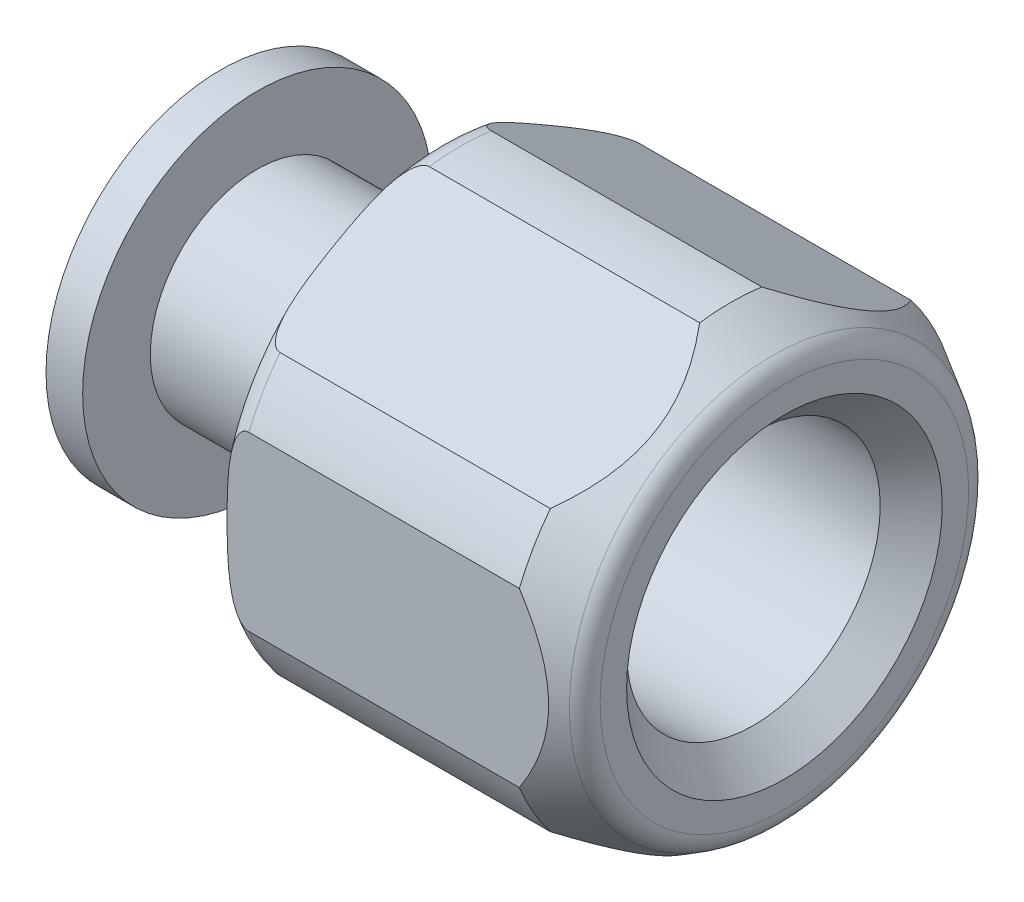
ISO-10303-21;
HEADER;
FILE_DESCRIPTION(('STEP AP214'),'2;1');
FILE_NAME('part.step','',(''),(''),'','','');
FILE_SCHEMA(('AUTOMOTIVE_DESIGN { 1 0 10303 214 1 1 1 1 }'));
ENDSEC;
DATA;
#1=APPLICATION_CONTEXT('core data for automotive mechanical design processes');
#2=APPLICATION_PROTOCOL_DEFINITION('international standard','automotive_design',2000,#1);
#3=PRODUCT_CONTEXT('',#1,'mechanical');
#4=PRODUCT('Part','Part','',(#3));
#5=PRODUCT_RELATED_PRODUCT_CATEGORY('part','',(#4));
#6=PRODUCT_DEFINITION_FORMATION('','',#4);
#7=PRODUCT_DEFINITION_CONTEXT('part definition',#1,'design');
#8=PRODUCT_DEFINITION('design','',#6,#7);
#9=PRODUCT_DEFINITION_SHAPE('','',#8);
#10=(LENGTH_UNIT() NAMED_UNIT(*) SI_UNIT(.MILLI.,.METRE.));
#11=(NAMED_UNIT(*) PLANE_ANGLE_UNIT() SI_UNIT($,.RADIAN.));
#12=(NAMED_UNIT(*) SI_UNIT($,.STERADIAN.) SOLID_ANGLE_UNIT());
#13=UNCERTAINTY_MEASURE_WITH_UNIT(LENGTH_MEASURE(1.E-05),#10,'distance_accuracy_value','');
#14=(GEOMETRIC_REPRESENTATION_CONTEXT(3) GLOBAL_UNCERTAINTY_ASSIGNED_CONTEXT((#13)) GLOBAL_UNIT_ASSIGNED_CONTEXT((#10,
#11,#12)) REPRESENTATION_CONTEXT('',''));
#15=CARTESIAN_POINT('',(0.,0.,0.));
#16=DIRECTION('',(0.,0.,1.));
#17=DIRECTION('',(1.,0.,0.));
#18=AXIS2_PLACEMENT_3D('',#15,#16,#17);
#19=CARTESIAN_POINT('',(0.,0.,0.));
#20=DIRECTION('',(-1.,0.,0.));
#21=DIRECTION('',(0.,0.,1.));
#22=AXIS2_PLACEMENT_3D('',#19,#20,#21);
#23=CYLINDRICAL_SURFACE('',#22,10.287);
#24=CARTESIAN_POINT('',(22.9803250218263,0.,0.));
#25=DIRECTION('',(-1.,0.,0.));
#26=DIRECTION('',(0.,0.,1.));
#27=AXIS2_PLACEMENT_3D('',#24,#25,#26);
#28=CIRCLE('',#27,10.287);
#29=CARTESIAN_POINT('',(22.9803250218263,10.1916184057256,1.39759910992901));
#30=VERTEX_POINT('',#29);
#31=CARTESIAN_POINT('',(22.9803250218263,10.1916184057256,-1.39759910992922));
#32=VERTEX_POINT('',#31);
#33=EDGE_CURVE('E160',#30,#32,#28,.T.);
#34=ORIENTED_EDGE('',*,*,#33,.T.);
#35=DIRECTION('',(-1.,0.,0.));
#36=VECTOR('',#35,1.);
#37=CARTESIAN_POINT('',(0.,10.1916184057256,-1.39759910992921));
#38=LINE('',#37,#36);
#39=CARTESIAN_POINT('',(10.795,10.1916184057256,-1.39759910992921));
#40=VERTEX_POINT('',#39);
#41=EDGE_CURVE('E37',#32,#40,#38,.T.);
#42=ORIENTED_EDGE('',*,*,#41,.T.);
#43=CARTESIAN_POINT('',(10.795,0.,0.));
#44=DIRECTION('',(-1.,0.,0.));
#45=DIRECTION('',(0.,0.,1.));
#46=AXIS2_PLACEMENT_3D('',#43,#44,#45);
#47=CIRCLE('',#46,10.287);
#48=CARTESIAN_POINT('',(10.795,10.1916184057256,1.397599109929));
#49=VERTEX_POINT('',#48);
#50=EDGE_CURVE('E187',#49,#40,#47,.T.);
#51=ORIENTED_EDGE('',*,*,#50,.F.);
#52=DIRECTION('',(-1.,0.,0.));
#53=VECTOR('',#52,1.);
#54=CARTESIAN_POINT('',(0.,10.1916184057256,1.397599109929));
#55=LINE('',#54,#53);
#56=EDGE_CURVE('E505',#49,#30,#55,.F.);
#57=ORIENTED_EDGE('',*,*,#56,.T.);
#58=EDGE_LOOP('',(#34,#42,#51,#57));
#59=FACE_BOUND('',#58,.T.);
#60=ADVANCED_FACE('F16',(#59),#23,.T.);
#61=CARTESIAN_POINT('',(22.9803250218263,3.88545286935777,9.52499999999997));
#62=VERTEX_POINT('',#61);
#63=CARTESIAN_POINT('',(22.9803250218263,6.30616553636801,8.12740089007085));
#64=VERTEX_POINT('',#63);
#65=EDGE_CURVE('E170',#62,#64,#28,.T.);
#66=ORIENTED_EDGE('',*,*,#65,.T.);
#67=DIRECTION('',(-1.,0.,0.));
#68=VECTOR('',#67,1.);
#69=CARTESIAN_POINT('',(0.,6.30616553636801,8.12740089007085));
#70=LINE('',#69,#68);
#71=CARTESIAN_POINT('',(10.795,6.30616553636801,8.12740089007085));
#72=VERTEX_POINT('',#71);
#73=EDGE_CURVE('E47',#64,#72,#70,.T.);
#74=ORIENTED_EDGE('',*,*,#73,.T.);
#75=CARTESIAN_POINT('',(10.795,3.88545286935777,9.52499999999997));
#76=VERTEX_POINT('',#75);
#77=EDGE_CURVE('E789',#76,#72,#47,.T.);
#78=ORIENTED_EDGE('',*,*,#77,.F.);
#79=DIRECTION('',(-1.,0.,0.));
#80=VECTOR('',#79,1.);
#81=CARTESIAN_POINT('',(0.,3.88545286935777,9.52499999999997));
#82=LINE('',#81,#80);
#83=EDGE_CURVE('E221',#76,#62,#82,.F.);
#84=ORIENTED_EDGE('',*,*,#83,.T.);
#85=EDGE_LOOP('',(#66,#74,#78,#84));
#86=FACE_BOUND('',#85,.T.);
#87=ADVANCED_FACE('F218',(#86),#23,.T.);
#88=CARTESIAN_POINT('',(22.9803250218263,-6.3061655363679,8.12740089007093));
#89=VERTEX_POINT('',#88);
#90=CARTESIAN_POINT('',(22.9803250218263,-3.88545286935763,9.52500000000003));
#91=VERTEX_POINT('',#90);
#92=EDGE_CURVE('E191',#89,#91,#28,.T.);
#93=ORIENTED_EDGE('',*,*,#92,.T.);
#94=DIRECTION('',(-1.,0.,0.));
#95=VECTOR('',#94,1.);
#96=CARTESIAN_POINT('',(0.,-3.88545286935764,9.52500000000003));
#97=LINE('',#96,#95);
#98=CARTESIAN_POINT('',(10.795,-3.88545286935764,9.52500000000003));
#99=VERTEX_POINT('',#98);
#100=EDGE_CURVE('E318',#91,#99,#97,.T.);
#101=ORIENTED_EDGE('',*,*,#100,.T.);
#102=CARTESIAN_POINT('',(10.795,-6.3061655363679,8.12740089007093));
#103=VERTEX_POINT('',#102);
#104=EDGE_CURVE('E378',#103,#99,#47,.T.);
#105=ORIENTED_EDGE('',*,*,#104,.F.);
#106=DIRECTION('',(-1.,0.,0.));
#107=VECTOR('',#106,1.);
#108=CARTESIAN_POINT('',(0.,-6.3061655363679,8.12740089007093));
#109=LINE('',#108,#107);
#110=EDGE_CURVE('E317',#103,#89,#109,.F.);
#111=ORIENTED_EDGE('',*,*,#110,.T.);
#112=EDGE_LOOP('',(#93,#101,#105,#111));
#113=FACE_BOUND('',#112,.T.);
#114=ADVANCED_FACE('F427',(#113),#23,.T.);
#115=CARTESIAN_POINT('',(22.9803250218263,-10.1916184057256,-1.39759910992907));
#116=VERTEX_POINT('',#115);
#117=CARTESIAN_POINT('',(22.9803250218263,-10.1916184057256,1.39759910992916));
#118=VERTEX_POINT('',#117);
#119=EDGE_CURVE('E178',#116,#118,#28,.T.);
#120=ORIENTED_EDGE('',*,*,#119,.T.);
#121=DIRECTION('',(-1.,0.,0.));
#122=VECTOR('',#121,1.);
#123=CARTESIAN_POINT('',(0.,-10.1916184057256,1.39759910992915));
#124=LINE('',#123,#122);
#125=CARTESIAN_POINT('',(10.795,-10.1916184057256,1.39759910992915));
#126=VERTEX_POINT('',#125);
#127=EDGE_CURVE('E320',#118,#126,#124,.T.);
#128=ORIENTED_EDGE('',*,*,#127,.T.);
#129=CARTESIAN_POINT('',(10.795,-10.1916184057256,-1.39759910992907));
#130=VERTEX_POINT('',#129);
#131=EDGE_CURVE('E369',#130,#126,#47,.T.);
#132=ORIENTED_EDGE('',*,*,#131,.F.);
#133=DIRECTION('',(-1.,0.,0.));
#134=VECTOR('',#133,1.);
#135=CARTESIAN_POINT('',(0.,-10.1916184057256,-1.39759910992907));
#136=LINE('',#135,#134);
#137=EDGE_CURVE('E329',#130,#116,#136,.F.);
#138=ORIENTED_EDGE('',*,*,#137,.T.);
#139=EDGE_LOOP('',(#120,#128,#132,#138));
#140=FACE_BOUND('',#139,.T.);
#141=ADVANCED_FACE('F434',(#140),#23,.T.);
#142=CARTESIAN_POINT('',(22.9803250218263,-3.8854528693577,-9.525));
#143=VERTEX_POINT('',#142);
#144=CARTESIAN_POINT('',(22.9803250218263,-6.30616553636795,-8.12740089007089));
#145=VERTEX_POINT('',#144);
#146=EDGE_CURVE('E163',#143,#145,#28,.T.);
#147=ORIENTED_EDGE('',*,*,#146,.T.);
#148=DIRECTION('',(-1.,0.,0.));
#149=VECTOR('',#148,1.);
#150=CARTESIAN_POINT('',(0.,-6.30616553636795,-8.12740089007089));
#151=LINE('',#150,#149);
#152=CARTESIAN_POINT('',(10.795,-6.30616553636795,-8.12740089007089));
#153=VERTEX_POINT('',#152);
#154=EDGE_CURVE('E337',#145,#153,#151,.T.);
#155=ORIENTED_EDGE('',*,*,#154,.T.);
#156=CARTESIAN_POINT('',(10.795,-3.8854528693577,-9.525));
#157=VERTEX_POINT('',#156);
#158=EDGE_CURVE('E188',#157,#153,#47,.T.);
#159=ORIENTED_EDGE('',*,*,#158,.F.);
#160=DIRECTION('',(-1.,0.,0.));
#161=VECTOR('',#160,1.);
#162=CARTESIAN_POINT('',(0.,-3.8854528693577,-9.525));
#163=LINE('',#162,#161);
#164=EDGE_CURVE('E350',#157,#143,#163,.F.);
#165=ORIENTED_EDGE('',*,*,#164,.T.);
#166=EDGE_LOOP('',(#147,#155,#159,#165));
#167=FACE_BOUND('',#166,.T.);
#168=ADVANCED_FACE('F366',(#167),#23,.T.);
#169=CARTESIAN_POINT('',(0.,0.,0.));
#170=DIRECTION('',(1.,0.,0.));
#171=DIRECTION('',(0.,0.,-1.));
#172=AXIS2_PLACEMENT_3D('',#169,#170,#171);
#173=PLANE('',#172);
#174=CARTESIAN_POINT('',(0.,0.,0.));
#175=DIRECTION('',(-1.,0.,0.));
#176=DIRECTION('',(0.,0.,1.));
#177=AXIS2_PLACEMENT_3D('',#174,#175,#176);
#178=CIRCLE('',#177,2.7686);
#179=CARTESIAN_POINT('',(0.,0.,2.7686));
#180=VERTEX_POINT('',#179);
#181=EDGE_CURVE('E697',#180,#180,#178,.T.);
#182=ORIENTED_EDGE('',*,*,#181,.F.);
#183=EDGE_LOOP('',(#182));
#184=FACE_BOUND('',#183,.T.);
#185=CARTESIAN_POINT('',(0.,0.,0.));
#186=DIRECTION('',(-1.,0.,0.));
#187=DIRECTION('',(0.,0.,1.));
#188=AXIS2_PLACEMENT_3D('',#185,#186,#187);
#189=CIRCLE('',#188,7.87399999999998);
#190=CARTESIAN_POINT('',(0.,0.,7.87399999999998));
#191=VERTEX_POINT('',#190);
#192=EDGE_CURVE('E390',#191,#191,#189,.T.);
#193=ORIENTED_EDGE('',*,*,#192,.T.);
#194=EDGE_LOOP('',(#193));
#195=FACE_BOUND('',#194,.T.);
#196=ADVANCED_FACE('F433',(#184,#195),#173,.F.);
#197=CARTESIAN_POINT('',(0.,0.,0.));
#198=DIRECTION('',(-1.,0.,0.));
#199=DIRECTION('',(0.,0.,1.));
#200=AXIS2_PLACEMENT_3D('',#197,#198,#199);
#201=CYLINDRICAL_SURFACE('',#200,7.87399999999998);
#202=ORIENTED_EDGE('',*,*,#192,.F.);
#203=EDGE_LOOP('',(#202));
#204=FACE_BOUND('',#203,.T.);
#205=CARTESIAN_POINT('',(1.651,0.,0.));
#206=DIRECTION('',(-1.,0.,0.));
#207=DIRECTION('',(0.,0.,1.));
#208=AXIS2_PLACEMENT_3D('',#205,#206,#207);
#209=CIRCLE('',#208,7.87399999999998);
#210=CARTESIAN_POINT('',(1.651,0.,7.87399999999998));
#211=VERTEX_POINT('',#210);
#212=EDGE_CURVE('E387',#211,#211,#209,.T.);
#213=ORIENTED_EDGE('',*,*,#212,.T.);
#214=EDGE_LOOP('',(#213));
#215=FACE_BOUND('',#214,.T.);
#216=ADVANCED_FACE('F440',(#204,#215),#201,.T.);
#217=CARTESIAN_POINT('',(1.651,7.87399999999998,0.));
#218=DIRECTION('',(-1.,0.,0.));
#219=DIRECTION('',(0.,0.,1.));
#220=AXIS2_PLACEMENT_3D('',#217,#218,#219);
#221=PLANE('',#220);
#222=ORIENTED_EDGE('',*,*,#212,.F.);
#223=EDGE_LOOP('',(#222));
#224=FACE_BOUND('',#223,.T.);
#225=CARTESIAN_POINT('',(1.651,0.,0.));
#226=DIRECTION('',(-1.,0.,0.));
#227=DIRECTION('',(0.,0.,1.));
#228=AXIS2_PLACEMENT_3D('',#225,#226,#227);
#229=CIRCLE('',#228,4.826);
#230=CARTESIAN_POINT('',(1.651,0.,4.826));
#231=VERTEX_POINT('',#230);
#232=EDGE_CURVE('E383',#231,#231,#229,.T.);
#233=ORIENTED_EDGE('',*,*,#232,.T.);
#234=EDGE_LOOP('',(#233));
#235=FACE_BOUND('',#234,.T.);
#236=ADVANCED_FACE('F669',(#224,#235),#221,.F.);
#237=CARTESIAN_POINT('',(0.,0.,0.));
#238=DIRECTION('',(-1.,0.,0.));
#239=DIRECTION('',(0.,0.,1.));
#240=AXIS2_PLACEMENT_3D('',#237,#238,#239);
#241=CYLINDRICAL_SURFACE('',#240,4.826);
#242=ORIENTED_EDGE('',*,*,#232,.F.);
#243=EDGE_LOOP('',(#242));
#244=FACE_BOUND('',#243,.T.);
#245=CARTESIAN_POINT('',(9.77900000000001,0.,0.));
#246=DIRECTION('',(-1.,0.,0.));
#247=DIRECTION('',(0.,0.,1.));
#248=AXIS2_PLACEMENT_3D('',#245,#246,#247);
#249=CIRCLE('',#248,4.826);
#250=CARTESIAN_POINT('',(9.77900000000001,0.,4.826));
#251=VERTEX_POINT('',#250);
#252=EDGE_CURVE('E376',#251,#251,#249,.T.);
#253=ORIENTED_EDGE('',*,*,#252,.T.);
#254=EDGE_LOOP('',(#253));
#255=FACE_BOUND('',#254,.T.);
#256=ADVANCED_FACE('F660',(#244,#255),#241,.T.);
#257=CARTESIAN_POINT('',(9.77900000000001,4.826,0.));
#258=DIRECTION('',(1.,0.,0.));
#259=DIRECTION('',(0.,0.,-1.));
#260=AXIS2_PLACEMENT_3D('',#257,#258,#259);
#261=PLANE('',#260);
#262=ORIENTED_EDGE('',*,*,#252,.F.);
#263=EDGE_LOOP('',(#262));
#264=FACE_BOUND('',#263,.T.);
#265=CARTESIAN_POINT('',(9.77900000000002,0.,0.));
#266=DIRECTION('',(-1.,0.,0.));
#267=DIRECTION('',(0.,0.,1.));
#268=AXIS2_PLACEMENT_3D('',#265,#266,#267);
#269=CIRCLE('',#268,9.271);
#270=CARTESIAN_POINT('',(9.77900000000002,0.,9.271));
#271=VERTEX_POINT('',#270);
#272=EDGE_CURVE('E368',#271,#271,#269,.T.);
#273=ORIENTED_EDGE('',*,*,#272,.T.);
#274=EDGE_LOOP('',(#273));
#275=FACE_BOUND('',#274,.T.);
#276=ADVANCED_FACE('F278',(#264,#275),#261,.F.);
#277=CARTESIAN_POINT('',(10.795,0.,0.));
#278=DIRECTION('',(-1.,0.,0.));
#279=DIRECTION('',(0.,0.,1.));
#280=AXIS2_PLACEMENT_3D('',#277,#278,#279);
#281=TOROIDAL_SURFACE('',#280,9.271,1.016);
#282=ORIENTED_EDGE('',*,*,#272,.F.);
#283=EDGE_LOOP('',(#282));
#284=FACE_BOUND('',#283,.T.);
#285=ORIENTED_EDGE('',*,*,#50,.T.);
#286=CARTESIAN_POINT('',(10.7952,10.1916183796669,-1.39759915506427));
#287=CARTESIAN_POINT('',(10.7712951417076,10.1916567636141,-1.39753267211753));
#288=CARTESIAN_POINT('',(10.7474729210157,10.190515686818,-1.39950907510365));
#289=CARTESIAN_POINT('',(10.7008722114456,10.1861723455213,-1.40703196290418));
#290=CARTESIAN_POINT('',(10.6780846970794,10.1829946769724,-1.41253584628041));
#291=CARTESIAN_POINT('',(10.6288435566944,10.1739461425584,-1.42820836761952));
#292=CARTESIAN_POINT('',(10.6027233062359,10.1676292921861,-1.43914947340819));
#293=CARTESIAN_POINT('',(10.5527856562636,10.152961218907,-1.46455532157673));
#294=CARTESIAN_POINT('',(10.528980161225,10.1446001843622,-1.47903705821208));
#295=CARTESIAN_POINT('',(10.470475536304,10.1210718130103,-1.51978939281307));
#296=CARTESIAN_POINT('',(10.4375875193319,10.1047906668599,-1.54798916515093));
#297=CARTESIAN_POINT('',(10.3769454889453,10.0700335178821,-1.60819031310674));
#298=CARTESIAN_POINT('',(10.3492012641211,10.0515534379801,-1.64019875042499));
#299=CARTESIAN_POINT('',(10.2977105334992,10.0130933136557,-1.70681363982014));
#300=CARTESIAN_POINT('',(10.273991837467,9.99310411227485,-1.74143595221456));
#301=CARTESIAN_POINT('',(10.229961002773,9.95219811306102,-1.8122872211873));
#302=CARTESIAN_POINT('',(10.2096525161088,9.93128035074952,-1.84851784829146));
#303=CARTESIAN_POINT('',(10.1718045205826,9.88877135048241,-1.92214559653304));
#304=CARTESIAN_POINT('',(10.1542721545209,9.86717854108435,-1.95954543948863));
#305=CARTESIAN_POINT('',(10.1215819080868,9.82356870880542,-2.0350798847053));
#306=CARTESIAN_POINT('',(10.1064225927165,9.80155195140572,-2.0732140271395));
#307=CARTESIAN_POINT('',(10.0615585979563,9.73135294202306,-2.19480227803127));
#308=CARTESIAN_POINT('',(10.0354989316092,9.68258865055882,-2.27926450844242));
#309=CARTESIAN_POINT('',(9.99001804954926,9.58427921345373,-2.44954144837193));
#310=CARTESIAN_POINT('',(9.97060382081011,9.53473330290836,-2.53535748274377));
#311=CARTESIAN_POINT('',(9.93670223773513,9.43506797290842,-2.70798289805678));
#312=CARTESIAN_POINT('',(9.92223071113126,9.38494723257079,-2.79479456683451));
#313=CARTESIAN_POINT('',(9.8970838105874,9.28446656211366,-2.96883219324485));
#314=CARTESIAN_POINT('',(9.88640914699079,9.23410658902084,-3.05605822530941));
#315=CARTESIAN_POINT('',(9.86791071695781,9.1329558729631,-3.23125640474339));
#316=CARTESIAN_POINT('',(9.86010436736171,9.08216435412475,-3.319229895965));
#317=CARTESIAN_POINT('',(9.84674286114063,8.98050499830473,-3.49530906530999));
#318=CARTESIAN_POINT('',(9.84118791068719,8.92963715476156,-3.58341475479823));
#319=CARTESIAN_POINT('',(9.83181520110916,8.82795591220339,-3.75953183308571));
#320=CARTESIAN_POINT('',(9.8279942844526,8.77714258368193,-3.84754309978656));
#321=CARTESIAN_POINT('',(9.82168787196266,8.67549547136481,-4.02360106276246));
#322=CARTESIAN_POINT('',(9.8192023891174,8.62466168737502,-4.11164775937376));
#323=CARTESIAN_POINT('',(9.81484742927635,8.51143396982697,-4.30776391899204));
#324=CARTESIAN_POINT('',(9.81324619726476,8.44903752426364,-4.41583773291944));
#325=CARTESIAN_POINT('',(9.81135212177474,8.32422005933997,-4.63202792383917));
#326=CARTESIAN_POINT('',(9.81105969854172,8.26179903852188,-4.74014430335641));
#327=CARTESIAN_POINT('',(9.81172976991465,8.13716201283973,-4.95602196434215));
#328=CARTESIAN_POINT('',(9.81268817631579,8.07494600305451,-5.06378325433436));
#329=CARTESIAN_POINT('',(9.8160285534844,7.95052924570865,-5.27927939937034));
#330=CARTESIAN_POINT('',(9.81841038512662,7.8883284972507,-5.38701425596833));
#331=CARTESIAN_POINT('',(9.8261753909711,7.7415711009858,-5.64120552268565));
#332=CARTESIAN_POINT('',(9.83233015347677,7.65702389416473,-5.78764558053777));
#333=CARTESIAN_POINT('',(9.84973738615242,7.48802705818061,-6.08035668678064));
#334=CARTESIAN_POINT('',(9.86099089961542,7.40357745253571,-6.22662769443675));
#335=CARTESIAN_POINT('',(9.88673347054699,7.26132473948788,-6.47301662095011));
#336=CARTESIAN_POINT('',(9.89911756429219,7.20342861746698,-6.57329564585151));
#337=CARTESIAN_POINT('',(9.92907389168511,7.08788707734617,-6.7734194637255));
#338=CARTESIAN_POINT('',(9.9466519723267,7.03024201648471,-6.87326363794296));
#339=CARTESIAN_POINT('',(9.97909936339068,6.94236167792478,-7.0254768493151));
#340=CARTESIAN_POINT('',(9.99140399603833,6.91189024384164,-7.07825492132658));
#341=CARTESIAN_POINT('',(10.0184738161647,6.85122399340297,-7.18333194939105));
#342=CARTESIAN_POINT('',(10.0332385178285,6.82102912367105,-7.23563099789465));
#343=CARTESIAN_POINT('',(10.0657194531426,6.76110539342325,-7.33942194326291));
#344=CARTESIAN_POINT('',(10.0834291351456,6.73137565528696,-7.39091536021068));
#345=CARTESIAN_POINT('',(10.1225081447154,6.67253091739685,-7.49283743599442));
#346=CARTESIAN_POINT('',(10.1438751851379,6.64341554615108,-7.54326673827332));
#347=CARTESIAN_POINT('',(10.1860814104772,6.59236251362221,-7.63169318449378));
#348=CARTESIAN_POINT('',(10.2060243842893,6.57024118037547,-7.67000845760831));
#349=CARTESIAN_POINT('',(10.2494103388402,6.52681633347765,-7.74522249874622));
#350=CARTESIAN_POINT('',(10.2728584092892,6.50551406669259,-7.78211910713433));
#351=CARTESIAN_POINT('',(10.3242752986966,6.46404719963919,-7.85394182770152));
#352=CARTESIAN_POINT('',(10.3522808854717,6.44389382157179,-7.88884850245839));
#353=CARTESIAN_POINT('',(10.4137565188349,6.40577618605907,-7.95487018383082));
#354=CARTESIAN_POINT('',(10.4472101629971,6.38780563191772,-7.98599609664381));
#355=CARTESIAN_POINT('',(10.5043438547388,6.36275866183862,-8.02937872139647));
#356=CARTESIAN_POINT('',(10.5257486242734,6.35439294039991,-8.04386857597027));
#357=CARTESIAN_POINT('',(10.5706958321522,6.33922332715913,-8.07014311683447));
#358=CARTESIAN_POINT('',(10.5942365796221,6.33241821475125,-8.08192991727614));
#359=CARTESIAN_POINT('',(10.6398829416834,6.32167744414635,-8.10053347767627));
#360=CARTESIAN_POINT('',(10.661733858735,6.3174745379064,-8.10781312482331));
#361=CARTESIAN_POINT('',(10.7065089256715,6.31095149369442,-8.11911136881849));
#362=CARTESIAN_POINT('',(10.7294302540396,6.3086266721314,-8.12313807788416));
#363=CARTESIAN_POINT('',(10.7667239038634,6.30655168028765,-8.12673206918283));
#364=CARTESIAN_POINT('',(10.780961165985,6.30615241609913,-8.127423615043));
#365=CARTESIAN_POINT('',(10.7952,6.30616556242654,-8.12740084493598));
#366=B_SPLINE_CURVE_WITH_KNOTS('',3,(#286,#287,#288,#289,#290,#291,#292,#293,#294,#295,#296,
#297,#298,#299,#300,#301,#302,#303,#304,#305,#306,#307,#308,#309,#310,#311,#312,#313,#314,#315,
#316,#317,#318,#319,#320,#321,#322,#323,#324,#325,#326,#327,#328,#329,#330,#331,#332,#333,#334,
#335,#336,#337,#338,#339,#340,#341,#342,#343,#344,#345,#346,#347,#348,#349,#350,#351,#352,#353,
#354,#355,#356,#357,#358,#359,#360,#361,#362,#363,#364,#365),.UNSPECIFIED.,.F.,.F.,(4,2,2,2,2,2,
2,2,2,2,2,2,2,2,2,2,2,2,2,2,2,2,2,2,2,2,2,2,2,2,2,2,2,2,2,2,2,2,2,4),(0.,0.0714694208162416,
0.142091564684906,0.228653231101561,0.315638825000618,0.453700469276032,0.592022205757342,
0.731263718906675,0.870653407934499,1.01039610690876,1.15005397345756,1.45251913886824,
1.75530134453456,2.05904423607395,2.36284392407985,2.66845898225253,2.97410202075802,
3.27918625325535,3.58427345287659,3.95867440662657,4.33319556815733,4.70649570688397,
5.07975936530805,5.58733713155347,6.09501880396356,6.44430320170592,6.79398230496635,
6.98046110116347,7.16690311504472,7.35293577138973,7.53885251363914,7.68432759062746,
7.83001600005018,7.97694401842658,8.1234375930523,8.20474247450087,8.28598354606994,
8.35594244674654,8.42572633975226,8.46842346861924),.UNSPECIFIED.);
#367=CARTESIAN_POINT('',(10.795,6.30616553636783,-8.12740089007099));
#368=VERTEX_POINT('',#367);
#369=EDGE_CURVE('E846',#40,#368,#366,.T.);
#370=ORIENTED_EDGE('',*,*,#369,.T.);
#371=CARTESIAN_POINT('',(10.795,3.8854528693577,-9.525));
#372=VERTEX_POINT('',#371);
#373=EDGE_CURVE('E151',#368,#372,#47,.T.);
#374=ORIENTED_EDGE('',*,*,#373,.T.);
#375=CARTESIAN_POINT('',(9.81187003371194,0.211257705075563,-9.525));
#376=CARTESIAN_POINT('',(9.81088986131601,0.0416380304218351,-9.525));
#377=CARTESIAN_POINT('',(9.81107996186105,-0.127987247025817,-9.525));
#378=CARTESIAN_POINT('',(9.81386845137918,-0.467247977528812,-9.525));
#379=CARTESIAN_POINT('',(9.81646723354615,-0.636883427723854,-9.525));
#380=CARTESIAN_POINT('',(9.82492120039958,-0.975805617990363,-9.525));
#381=CARTESIAN_POINT('',(9.83077108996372,-1.14509247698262,-9.525));
#382=CARTESIAN_POINT('',(9.84741938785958,-1.48339808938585,-9.525));
#383=CARTESIAN_POINT('',(9.85821650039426,-1.6524169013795,-9.525));
#384=CARTESIAN_POINT('',(9.88540270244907,-1.96545034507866,-9.525));
#385=CARTESIAN_POINT('',(9.90075769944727,-2.10954726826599,-9.525));
#386=CARTESIAN_POINT('',(9.93009322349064,-2.32515152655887,-9.525));
#387=CARTESIAN_POINT('',(9.940951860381,-2.39708065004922,-9.525));
#388=CARTESIAN_POINT('',(9.96525714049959,-2.54049218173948,-9.525));
#389=CARTESIAN_POINT('',(9.97870323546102,-2.6119746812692,-9.525));
#390=CARTESIAN_POINT('',(10.0089740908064,-2.75517478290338,-9.525));
#391=CARTESIAN_POINT('',(10.0258393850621,-2.82688394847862,-9.525));
#392=CARTESIAN_POINT('',(10.063669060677,-2.96920761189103,-9.525));
#393=CARTESIAN_POINT('',(10.0846318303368,-3.03982252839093,-9.525));
#394=CARTESIAN_POINT('',(10.1316954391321,-3.17893277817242,-9.525));
#395=CARTESIAN_POINT('',(10.1577686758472,-3.2474373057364,-9.525));
#396=CARTESIAN_POINT('',(10.2167352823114,-3.38139225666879,-9.525));
#397=CARTESIAN_POINT('',(10.2496118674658,-3.44684971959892,-9.525));
#398=CARTESIAN_POINT('',(10.3112802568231,-3.54975978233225,-9.525));
#399=CARTESIAN_POINT('',(10.3373180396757,-3.58884613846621,-9.525));
#400=CARTESIAN_POINT('',(10.3942119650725,-3.66338641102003,-9.525));
#401=CARTESIAN_POINT('',(10.4250596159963,-3.69884655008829,-9.525));
#402=CARTESIAN_POINT('',(10.4807273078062,-3.75235037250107,-9.525));
#403=CARTESIAN_POINT('',(10.503857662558,-3.77213615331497,-9.525));
#404=CARTESIAN_POINT('',(10.5527817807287,-3.8081251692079,-9.525));
#405=CARTESIAN_POINT('',(10.5785717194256,-3.82433344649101,-9.525));
#406=CARTESIAN_POINT('',(10.626796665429,-3.84881037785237,-9.525));
#407=CARTESIAN_POINT('',(10.6487387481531,-3.85803943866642,-9.525));
#408=CARTESIAN_POINT('',(10.6938482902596,-3.8727501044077,-9.525));
#409=CARTESIAN_POINT('',(10.7170143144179,-3.87823599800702,-9.525));
#410=CARTESIAN_POINT('',(10.7641154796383,-3.8849392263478,-9.525));
#411=CARTESIAN_POINT('',(10.7880544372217,-3.88613043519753,-9.525));
#412=CARTESIAN_POINT('',(10.8357366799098,-3.88403135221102,-9.525));
#413=CARTESIAN_POINT('',(10.8594799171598,-3.88073999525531,-9.525));
#414=CARTESIAN_POINT('',(10.9039931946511,-3.87050642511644,-9.525));
#415=CARTESIAN_POINT('',(10.9248434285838,-3.86390213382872,-9.525));
#416=CARTESIAN_POINT('',(10.9653653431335,-3.84777213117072,-9.525));
#417=CARTESIAN_POINT('',(10.9850366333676,-3.83824545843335,-9.525));
#418=CARTESIAN_POINT('',(11.0347125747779,-3.81023699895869,-9.525));
#419=CARTESIAN_POINT('',(11.0636395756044,-3.78984954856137,-9.525));
#420=CARTESIAN_POINT('',(11.1180179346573,-3.74486333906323,-9.525));
#421=CARTESIAN_POINT('',(11.1434576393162,-3.72025105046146,-9.525));
#422=CARTESIAN_POINT('',(11.2099569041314,-3.64784018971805,-9.525));
#423=CARTESIAN_POINT('',(11.2476456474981,-3.59697904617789,-9.525));
#424=CARTESIAN_POINT('',(11.315587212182,-3.49065091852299,-9.525));
#425=CARTESIAN_POINT('',(11.3458257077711,-3.43517533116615,-9.525));
#426=CARTESIAN_POINT('',(11.4124736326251,-3.29719185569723,-9.525));
#427=CARTESIAN_POINT('',(11.4459682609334,-3.21329378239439,-9.525));
#428=CARTESIAN_POINT('',(11.5049732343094,-3.04267883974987,-9.525));
#429=CARTESIAN_POINT('',(11.5304657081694,-2.95595613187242,-9.525));
#430=CARTESIAN_POINT('',(11.5756721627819,-2.78030718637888,-9.525));
#431=CARTESIAN_POINT('',(11.5953386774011,-2.69136892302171,-9.525));
#432=CARTESIAN_POINT('',(11.6213730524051,-2.55737531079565,-9.525));
#433=CARTESIAN_POINT('',(11.6294697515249,-2.51264036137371,-9.525));
#434=CARTESIAN_POINT('',(11.6446485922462,-2.423000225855,-9.525));
#435=CARTESIAN_POINT('',(11.6517307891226,-2.37809504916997,-9.525));
#436=CARTESIAN_POINT('',(11.6729222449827,-2.2345268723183,-9.525));
#437=CARTESIAN_POINT('',(11.6853402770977,-2.13561381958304,-9.525));
#438=CARTESIAN_POINT('',(11.7069171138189,-1.93742735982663,-9.525));
#439=CARTESIAN_POINT('',(11.716075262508,-1.83815388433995,-9.525));
#440=CARTESIAN_POINT('',(11.731887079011,-1.63934253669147,-9.525));
#441=CARTESIAN_POINT('',(11.7385390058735,-1.53980452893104,-9.525));
#442=CARTESIAN_POINT('',(11.7499011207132,-1.34061573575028,-9.525));
#443=CARTESIAN_POINT('',(11.7546111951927,-1.24096494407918,-9.525));
#444=CARTESIAN_POINT('',(11.7665511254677,-0.941138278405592,-9.525));
#445=CARTESIAN_POINT('',(11.7715358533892,-0.740875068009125,-9.525));
#446=CARTESIAN_POINT('',(11.7777669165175,-0.3404016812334,-9.525));
#447=CARTESIAN_POINT('',(11.7790150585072,-0.14019152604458,-9.525));
#448=CARTESIAN_POINT('',(11.7783641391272,0.259405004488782,-9.525));
#449=CARTESIAN_POINT('',(11.7764779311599,0.458791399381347,-9.525));
#450=CARTESIAN_POINT('',(11.7687049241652,0.857613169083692,-9.525));
#451=CARTESIAN_POINT('',(11.7628159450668,1.05704851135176,-9.525));
#452=CARTESIAN_POINT('',(11.7490979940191,1.35557345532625,-9.525));
#453=CARTESIAN_POINT('',(11.7437273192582,1.45477335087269,-9.525));
#454=CARTESIAN_POINT('',(11.7308601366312,1.65303273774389,-9.525));
#455=CARTESIAN_POINT('',(11.7233637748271,1.75209223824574,-9.525));
#456=CARTESIAN_POINT('',(11.7056279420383,1.94988709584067,-9.525));
#457=CARTESIAN_POINT('',(11.6953907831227,2.04862265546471,-9.525));
#458=CARTESIAN_POINT('',(11.6713485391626,2.24565105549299,-9.525));
#459=CARTESIAN_POINT('',(11.6575442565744,2.34394399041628,-9.525));
#460=CARTESIAN_POINT('',(11.6287119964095,2.5187832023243,-9.525));
#461=CARTESIAN_POINT('',(11.6145802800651,2.59547553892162,-9.525));
#462=CARTESIAN_POINT('',(11.5826787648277,2.74818989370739,-9.525));
#463=CARTESIAN_POINT('',(11.5649056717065,2.82421123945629,-9.525));
#464=CARTESIAN_POINT('',(11.5247439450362,2.97504497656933,-9.525));
#465=CARTESIAN_POINT('',(11.5023551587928,3.04985732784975,-9.525));
#466=CARTESIAN_POINT('',(11.4515937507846,3.19739871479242,-9.525));
#467=CARTESIAN_POINT('',(11.4232293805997,3.27013046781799,-9.525));
#468=CARTESIAN_POINT('',(11.3743620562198,3.37699230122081,-9.525));
#469=CARTESIAN_POINT('',(11.3568658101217,3.4124946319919,-9.525));
#470=CARTESIAN_POINT('',(11.3193904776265,3.48215329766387,-9.525));
#471=CARTESIAN_POINT('',(11.2994130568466,3.51631051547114,-9.525));
#472=CARTESIAN_POINT('',(11.2566439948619,3.58248596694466,-9.525));
#473=CARTESIAN_POINT('',(11.2338739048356,3.61451796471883,-9.525));
#474=CARTESIAN_POINT('',(11.1848614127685,3.6757678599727,-9.525));
#475=CARTESIAN_POINT('',(11.1586270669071,3.7049920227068,-9.525));
#476=CARTESIAN_POINT('',(11.1110459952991,3.75059131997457,-9.525));
#477=CARTESIAN_POINT('',(11.0907931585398,3.76809949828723,-9.525));
#478=CARTESIAN_POINT('',(11.048212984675,3.80046116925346,-9.525));
#479=CARTESIAN_POINT('',(11.0258845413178,3.81531323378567,-9.525));
#480=CARTESIAN_POINT('',(10.9789175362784,3.84158919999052,-9.525));
#481=CARTESIAN_POINT('',(10.9542557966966,3.85297262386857,-9.525));
#482=CARTESIAN_POINT('',(10.9032529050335,3.87098801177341,-9.525));
#483=CARTESIAN_POINT('',(10.8769149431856,3.87762872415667,-9.525));
#484=CARTESIAN_POINT('',(10.8253741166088,3.88505526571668,-9.525));
#485=CARTESIAN_POINT('',(10.8002287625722,3.88623314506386,-9.525));
#486=CARTESIAN_POINT('',(10.7501926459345,3.88365194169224,-9.525));
#487=CARTESIAN_POINT('',(10.7253019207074,3.87989214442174,-9.525));
#488=CARTESIAN_POINT('',(10.6797671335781,3.86866580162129,-9.525));
#489=CARTESIAN_POINT('',(10.6589863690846,3.86173324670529,-9.525));
#490=CARTESIAN_POINT('',(10.6186334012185,3.8449937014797,-9.525));
#491=CARTESIAN_POINT('',(10.5990615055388,3.83518598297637,-9.525));
#492=CARTESIAN_POINT('',(10.5491332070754,3.80619767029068,-9.525));
#493=CARTESIAN_POINT('',(10.5199261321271,3.78504346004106,-9.525));
#494=CARTESIAN_POINT('',(10.465100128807,3.73850718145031,-9.525));
#495=CARTESIAN_POINT('',(10.4394927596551,3.71311204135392,-9.525));
#496=CARTESIAN_POINT('',(10.3722556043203,3.63812066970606,-9.525));
#497=CARTESIAN_POINT('',(10.3341583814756,3.58539130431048,-9.525));
#498=CARTESIAN_POINT('',(10.2655955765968,3.47526996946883,-9.525));
#499=CARTESIAN_POINT('',(10.2351510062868,3.41786572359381,-9.525));
#500=CARTESIAN_POINT('',(10.1675231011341,3.27381141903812,-9.525));
#501=CARTESIAN_POINT('',(10.1335266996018,3.18568424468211,-9.525));
#502=CARTESIAN_POINT('',(10.0739110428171,3.00658285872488,-9.525));
#503=CARTESIAN_POINT('',(10.0483107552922,2.91560270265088,-9.525));
#504=CARTESIAN_POINT('',(10.0032080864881,2.7317141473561,-9.525));
#505=CARTESIAN_POINT('',(9.9837352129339,2.63879864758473,-9.525));
#506=CARTESIAN_POINT('',(9.94953040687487,2.45221969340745,-9.525));
#507=CARTESIAN_POINT('',(9.93479386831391,2.35855705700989,-9.525));
#508=CARTESIAN_POINT('',(9.91017259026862,2.17965371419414,-9.525));
#509=CARTESIAN_POINT('',(9.89996019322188,2.09445701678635,-9.525));
#510=CARTESIAN_POINT('',(9.88190229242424,1.92380994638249,-9.525));
#511=CARTESIAN_POINT('',(9.87405701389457,1.83835955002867,-9.525));
#512=CARTESIAN_POINT('',(9.85332109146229,1.58168904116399,-9.525));
#513=CARTESIAN_POINT('',(9.84324227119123,1.41024488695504,-9.525));
#514=CARTESIAN_POINT('',(9.82785745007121,1.06755140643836,-9.525));
#515=CARTESIAN_POINT('',(9.82254098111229,0.896302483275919,-9.525));
#516=CARTESIAN_POINT('',(9.81504258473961,0.553790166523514,-9.525));
#517=CARTESIAN_POINT('',(9.81285973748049,0.382526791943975,-9.525));
#518=CARTESIAN_POINT('',(9.81187003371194,0.211257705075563,-9.525));
#519=B_SPLINE_CURVE_WITH_KNOTS('',3,(#375,#376,#377,#378,#379,#380,#381,#382,#383,#384,#385,
#386,#387,#388,#389,#390,#391,#392,#393,#394,#395,#396,#397,#398,#399,#400,#401,#402,#403,#404,
#405,#406,#407,#408,#409,#410,#411,#412,#413,#414,#415,#416,#417,#418,#419,#420,#421,#422,#423,
#424,#425,#426,#427,#428,#429,#430,#431,#432,#433,#434,#435,#436,#437,#438,#439,#440,#441,#442,
#443,#444,#445,#446,#447,#448,#449,#450,#451,#452,#453,#454,#455,#456,#457,#458,#459,#460,#461,
#462,#463,#464,#465,#466,#467,#468,#469,#470,#471,#472,#473,#474,#475,#476,#477,#478,#479,#480,
#481,#482,#483,#484,#485,#486,#487,#488,#489,#490,#491,#492,#493,#494,#495,#496,#497,#498,#499,
#500,#501,#502,#503,#504,#505,#506,#507,#508,#509,#510,#511,#512,#513,#514,#515,#516,#517,#518),
.UNSPECIFIED.,.T.,.F.,(4,2,2,2,2,2,2,2,2,2,2,2,2,2,2,2,2,2,2,2,2,2,2,2,2,2,2,2,2,2,2,2,2,2,2,2,
2,2,2,2,2,2,2,2,2,2,2,2,2,2,2,2,2,2,2,2,2,2,2,2,2,2,2,2,2,2,2,2,2,2,2,4),(0.,0.508861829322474,
1.01780674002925,1.52592514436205,2.03391053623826,2.46845674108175,2.68665278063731,
2.90480263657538,3.12570817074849,3.34652698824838,3.56618445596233,3.78530633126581,
3.92595129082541,4.0663507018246,4.15742578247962,4.24837166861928,4.31950682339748,
4.39056033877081,4.46204537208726,4.53354739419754,4.598906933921,4.66428799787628,
4.76984298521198,4.87574252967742,5.06458048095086,5.25377875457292,5.52411445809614,
5.79504967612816,6.06813514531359,6.2045126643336,6.34088275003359,6.63987023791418,
6.93891785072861,7.23817281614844,7.53744526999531,8.13835562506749,8.73897536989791,
9.33713815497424,9.93562698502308,10.2336458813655,10.5316443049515,10.8293921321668,
11.1270730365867,11.3609580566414,11.5950556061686,11.8291609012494,12.0629450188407,
12.1816079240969,12.3001915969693,12.4179117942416,12.5353629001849,12.6155120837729,
12.6957042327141,12.7767992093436,12.8577442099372,12.9327796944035,13.007826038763,
13.073299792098,13.1387901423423,13.2463533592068,13.3542544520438,13.5483108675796,
13.7428944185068,14.0255504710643,14.308840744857,14.5934750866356,14.8778317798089,
15.1352114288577,15.3926155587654,15.9077115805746,16.4216725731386,16.9354826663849),.UNSPECIFIED.);
#520=EDGE_CURVE('E161',#372,#157,#519,.T.);
#521=ORIENTED_EDGE('',*,*,#520,.T.);
#522=ORIENTED_EDGE('',*,*,#158,.T.);
#523=CARTESIAN_POINT('',(10.7952,-6.30616556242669,-8.12740084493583));
#524=CARTESIAN_POINT('',(10.7712951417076,-6.30612717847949,-8.12746732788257));
#525=CARTESIAN_POINT('',(10.7474729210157,-6.30726825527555,-8.12549092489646));
#526=CARTESIAN_POINT('',(10.7008722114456,-6.31161159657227,-8.11796803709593));
#527=CARTESIAN_POINT('',(10.6780846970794,-6.31478926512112,-8.1124641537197));
#528=CARTESIAN_POINT('',(10.6288435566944,-6.32383779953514,-8.09679163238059));
#529=CARTESIAN_POINT('',(10.6027233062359,-6.33015464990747,-8.08585052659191));
#530=CARTESIAN_POINT('',(10.5527856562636,-6.34482272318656,-8.06044467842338));
#531=CARTESIAN_POINT('',(10.528980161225,-6.35318375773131,-8.04596294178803));
#532=CARTESIAN_POINT('',(10.470475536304,-6.3767121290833,-8.00521060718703));
#533=CARTESIAN_POINT('',(10.4375875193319,-6.39299327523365,-7.97701083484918));
#534=CARTESIAN_POINT('',(10.3769454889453,-6.42775042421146,-7.91680968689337));
#535=CARTESIAN_POINT('',(10.3492012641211,-6.44623050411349,-7.88480124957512));
#536=CARTESIAN_POINT('',(10.2977105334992,-6.48469062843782,-7.81818636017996));
#537=CARTESIAN_POINT('',(10.273991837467,-6.5046798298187,-7.78356404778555));
#538=CARTESIAN_POINT('',(10.229961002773,-6.54558582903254,-7.71271277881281));
#539=CARTESIAN_POINT('',(10.2096525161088,-6.56650359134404,-7.67648215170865));
#540=CARTESIAN_POINT('',(10.1718045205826,-6.60901259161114,-7.60285440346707));
#541=CARTESIAN_POINT('',(10.1542721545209,-6.6306054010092,-7.56545456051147));
#542=CARTESIAN_POINT('',(10.1215819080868,-6.67421523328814,-7.4899201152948));
#543=CARTESIAN_POINT('',(10.1064225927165,-6.69623199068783,-7.45178597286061));
#544=CARTESIAN_POINT('',(10.0615585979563,-6.76643100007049,-7.33019772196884));
#545=CARTESIAN_POINT('',(10.0354989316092,-6.81519529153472,-7.24573549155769));
#546=CARTESIAN_POINT('',(9.99001804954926,-6.91350472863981,-7.07545855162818));
#547=CARTESIAN_POINT('',(9.97060382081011,-6.96305063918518,-6.98964251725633));
#548=CARTESIAN_POINT('',(9.93670223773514,-7.06271596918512,-6.81701710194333));
#549=CARTESIAN_POINT('',(9.92223071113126,-7.11283670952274,-6.7302054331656));
#550=CARTESIAN_POINT('',(9.8970838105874,-7.21331737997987,-6.55616780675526));
#551=CARTESIAN_POINT('',(9.88640914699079,-7.26367735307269,-6.4689417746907));
#552=CARTESIAN_POINT('',(9.86791071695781,-7.36482806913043,-6.29374359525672));
#553=CARTESIAN_POINT('',(9.86010436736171,-7.41561958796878,-6.20577010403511));
#554=CARTESIAN_POINT('',(9.84674286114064,-7.51727894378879,-6.02969093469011));
#555=CARTESIAN_POINT('',(9.84118791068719,-7.56814678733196,-5.94158524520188));
#556=CARTESIAN_POINT('',(9.83181520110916,-7.66982802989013,-5.7654681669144));
#557=CARTESIAN_POINT('',(9.8279942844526,-7.72064135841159,-5.67745690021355));
#558=CARTESIAN_POINT('',(9.82168787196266,-7.8222884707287,-5.50139893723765));
#559=CARTESIAN_POINT('',(9.8192023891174,-7.87312225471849,-5.41335224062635));
#560=CARTESIAN_POINT('',(9.81484742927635,-7.98634997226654,-5.21723608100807));
#561=CARTESIAN_POINT('',(9.81324619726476,-8.04874641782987,-5.10916226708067));
#562=CARTESIAN_POINT('',(9.81135212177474,-8.17356388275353,-4.89297207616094));
#563=CARTESIAN_POINT('',(9.81105969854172,-8.23598490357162,-4.7848556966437));
#564=CARTESIAN_POINT('',(9.81172976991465,-8.36062192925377,-4.56897803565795));
#565=CARTESIAN_POINT('',(9.81268817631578,-8.42283793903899,-4.46121674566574));
#566=CARTESIAN_POINT('',(9.81602855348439,-8.54725469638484,-4.24572060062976));
#567=CARTESIAN_POINT('',(9.81841038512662,-8.60945544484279,-4.13798574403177));
#568=CARTESIAN_POINT('',(9.8261753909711,-8.75621284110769,-3.88379447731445));
#569=CARTESIAN_POINT('',(9.83233015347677,-8.84076004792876,-3.73735441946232));
#570=CARTESIAN_POINT('',(9.84973738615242,-9.00975688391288,-3.44464331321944));
#571=CARTESIAN_POINT('',(9.86099089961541,-9.09420648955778,-3.29837230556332));
#572=CARTESIAN_POINT('',(9.88673347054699,-9.23645920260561,-3.05198337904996));
#573=CARTESIAN_POINT('',(9.89911756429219,-9.29435532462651,-2.95170435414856));
#574=CARTESIAN_POINT('',(9.92907389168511,-9.40989686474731,-2.75158053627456));
#575=CARTESIAN_POINT('',(9.9466519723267,-9.46754192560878,-2.65173636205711));
#576=CARTESIAN_POINT('',(9.97909936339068,-9.5554222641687,-2.49952315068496));
#577=CARTESIAN_POINT('',(9.99140399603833,-9.58589369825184,-2.44674507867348));
#578=CARTESIAN_POINT('',(10.0184738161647,-9.64655994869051,-2.34166805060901));
#579=CARTESIAN_POINT('',(10.0332385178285,-9.67675481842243,-2.2893690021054));
#580=CARTESIAN_POINT('',(10.0657194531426,-9.73667854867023,-2.18557805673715));
#581=CARTESIAN_POINT('',(10.0834291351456,-9.76640828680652,-2.13408463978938));
#582=CARTESIAN_POINT('',(10.1225081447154,-9.82525302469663,-2.03216256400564));
#583=CARTESIAN_POINT('',(10.1438751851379,-9.8543683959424,-1.98173326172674));
#584=CARTESIAN_POINT('',(10.1860814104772,-9.90542142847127,-1.89330681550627));
#585=CARTESIAN_POINT('',(10.2060243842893,-9.92754276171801,-1.85499154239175));
#586=CARTESIAN_POINT('',(10.2494103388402,-9.97096760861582,-1.77977750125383));
#587=CARTESIAN_POINT('',(10.2728584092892,-9.99226987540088,-1.74288089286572));
#588=CARTESIAN_POINT('',(10.3242752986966,-10.0337367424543,-1.67105817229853));
#589=CARTESIAN_POINT('',(10.3522808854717,-10.0538901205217,-1.63615149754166));
#590=CARTESIAN_POINT('',(10.4137565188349,-10.0920077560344,-1.57012981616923));
#591=CARTESIAN_POINT('',(10.4472101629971,-10.1099783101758,-1.53900390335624));
#592=CARTESIAN_POINT('',(10.5043438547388,-10.1350252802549,-1.49562127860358));
#593=CARTESIAN_POINT('',(10.5257486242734,-10.1433910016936,-1.48113142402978));
#594=CARTESIAN_POINT('',(10.5706958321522,-10.1585606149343,-1.45485688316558));
#595=CARTESIAN_POINT('',(10.5942365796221,-10.1653657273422,-1.44307008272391));
#596=CARTESIAN_POINT('',(10.6398829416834,-10.1761064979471,-1.42446652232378));
#597=CARTESIAN_POINT('',(10.661733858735,-10.1803094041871,-1.41718687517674));
#598=CARTESIAN_POINT('',(10.7065089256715,-10.1868324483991,-1.40588863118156));
#599=CARTESIAN_POINT('',(10.7294302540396,-10.1891572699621,-1.40186192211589));
#600=CARTESIAN_POINT('',(10.7667239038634,-10.1912322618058,-1.39826793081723));
#601=CARTESIAN_POINT('',(10.780961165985,-10.1916315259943,-1.39757638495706));
#602=CARTESIAN_POINT('',(10.7952,-10.1916183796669,-1.39759915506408));
#603=B_SPLINE_CURVE_WITH_KNOTS('',3,(#523,#524,#525,#526,#527,#528,#529,#530,#531,#532,#533,
#534,#535,#536,#537,#538,#539,#540,#541,#542,#543,#544,#545,#546,#547,#548,#549,#550,#551,#552,
#553,#554,#555,#556,#557,#558,#559,#560,#561,#562,#563,#564,#565,#566,#567,#568,#569,#570,#571,
#572,#573,#574,#575,#576,#577,#578,#579,#580,#581,#582,#583,#584,#585,#586,#587,#588,#589,#590,
#591,#592,#593,#594,#595,#596,#597,#598,#599,#600,#601,#602),.UNSPECIFIED.,.F.,.F.,(4,2,2,2,2,2,
2,2,2,2,2,2,2,2,2,2,2,2,2,2,2,2,2,2,2,2,2,2,2,2,2,2,2,2,2,2,2,2,2,4),(0.,0.0714694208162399,
0.142091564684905,0.22865323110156,0.315638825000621,0.453700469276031,0.592022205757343,
0.731263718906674,0.870653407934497,1.01039610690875,1.15005397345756,1.45251913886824,
1.75530134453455,2.05904423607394,2.36284392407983,2.66845898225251,2.974102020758,
3.27918625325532,3.58427345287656,3.95867440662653,4.3331955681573,4.70649570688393,
5.07975936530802,5.58733713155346,6.09501880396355,6.44430320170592,6.79398230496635,
6.98046110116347,7.16690311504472,7.35293577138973,7.53885251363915,7.68432759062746,
7.83001600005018,7.97694401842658,8.1234375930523,8.20474247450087,8.28598354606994,
8.35594244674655,8.42572633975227,8.46842346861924),.UNSPECIFIED.);
#604=EDGE_CURVE('E292',#153,#130,#603,.T.);
#605=ORIENTED_EDGE('',*,*,#604,.T.);
#606=ORIENTED_EDGE('',*,*,#131,.T.);
#607=CARTESIAN_POINT('',(10.7952,-10.1916183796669,1.3975991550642));
#608=CARTESIAN_POINT('',(10.7712951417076,-10.1916567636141,1.39753267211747));
#609=CARTESIAN_POINT('',(10.7474729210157,-10.190515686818,1.39950907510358));
#610=CARTESIAN_POINT('',(10.7008722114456,-10.1861723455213,1.40703196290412));
#611=CARTESIAN_POINT('',(10.6780846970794,-10.1829946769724,1.41253584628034));
#612=CARTESIAN_POINT('',(10.6288435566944,-10.1739461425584,1.42820836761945));
#613=CARTESIAN_POINT('',(10.6027233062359,-10.1676292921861,1.43914947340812));
#614=CARTESIAN_POINT('',(10.5527856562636,-10.152961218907,1.46455532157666));
#615=CARTESIAN_POINT('',(10.528980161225,-10.1446001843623,1.47903705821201));
#616=CARTESIAN_POINT('',(10.470475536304,-10.1210718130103,1.51978939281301));
#617=CARTESIAN_POINT('',(10.4375875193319,-10.1047906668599,1.54798916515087));
#618=CARTESIAN_POINT('',(10.3769454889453,-10.0700335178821,1.60819031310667));
#619=CARTESIAN_POINT('',(10.3492012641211,-10.0515534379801,1.64019875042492));
#620=CARTESIAN_POINT('',(10.2977105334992,-10.0130933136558,1.70681363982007));
#621=CARTESIAN_POINT('',(10.273991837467,-9.99310411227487,1.74143595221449));
#622=CARTESIAN_POINT('',(10.229961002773,-9.95219811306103,1.81228722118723));
#623=CARTESIAN_POINT('',(10.2096525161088,-9.93128035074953,1.84851784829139));
#624=CARTESIAN_POINT('',(10.1718045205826,-9.88877135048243,1.92214559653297));
#625=CARTESIAN_POINT('',(10.1542721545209,-9.86717854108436,1.95954543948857));
#626=CARTESIAN_POINT('',(10.1215819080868,-9.82356870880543,2.03507988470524));
#627=CARTESIAN_POINT('',(10.1064225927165,-9.80155195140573,2.07321402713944));
#628=CARTESIAN_POINT('',(10.0615585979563,-9.73135294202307,2.19480227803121));
#629=CARTESIAN_POINT('',(10.0354989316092,-9.68258865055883,2.27926450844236));
#630=CARTESIAN_POINT('',(9.99001804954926,-9.58427921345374,2.44954144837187));
#631=CARTESIAN_POINT('',(9.97060382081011,-9.53473330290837,2.53535748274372));
#632=CARTESIAN_POINT('',(9.93670223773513,-9.43506797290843,2.70798289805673));
#633=CARTESIAN_POINT('',(9.92223071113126,-9.38494723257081,2.79479456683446));
#634=CARTESIAN_POINT('',(9.8970838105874,-9.28446656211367,2.9688321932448));
#635=CARTESIAN_POINT('',(9.88640914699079,-9.23410658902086,3.05605822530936));
#636=CARTESIAN_POINT('',(9.86791071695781,-9.13295587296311,3.23125640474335));
#637=CARTESIAN_POINT('',(9.86010436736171,-9.08216435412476,3.31922989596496));
#638=CARTESIAN_POINT('',(9.84674286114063,-8.98050499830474,3.49530906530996));
#639=CARTESIAN_POINT('',(9.84118791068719,-8.92963715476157,3.5834147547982));
#640=CARTESIAN_POINT('',(9.83181520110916,-8.8279559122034,3.75953183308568));
#641=CARTESIAN_POINT('',(9.8279942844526,-8.77714258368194,3.84754309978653));
#642=CARTESIAN_POINT('',(9.82168787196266,-8.67549547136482,4.02360106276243));
#643=CARTESIAN_POINT('',(9.8192023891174,-8.62466168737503,4.11164775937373));
#644=CARTESIAN_POINT('',(9.81484742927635,-8.51143396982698,4.30776391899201));
#645=CARTESIAN_POINT('',(9.81324619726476,-8.44903752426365,4.41583773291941));
#646=CARTESIAN_POINT('',(9.81135212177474,-8.32422005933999,4.63202792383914));
#647=CARTESIAN_POINT('',(9.81105969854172,-8.2617990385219,4.74014430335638));
#648=CARTESIAN_POINT('',(9.81172976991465,-8.13716201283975,4.95602196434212));
#649=CARTESIAN_POINT('',(9.81268817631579,-8.07494600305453,5.06378325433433));
#650=CARTESIAN_POINT('',(9.8160285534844,-7.95052924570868,5.27927939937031));
#651=CARTESIAN_POINT('',(9.81841038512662,-7.88832849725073,5.38701425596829));
#652=CARTESIAN_POINT('',(9.8261753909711,-7.74157110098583,5.64120552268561));
#653=CARTESIAN_POINT('',(9.83233015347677,-7.65702389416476,5.78764558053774));
#654=CARTESIAN_POINT('',(9.84973738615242,-7.48802705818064,6.08035668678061));
#655=CARTESIAN_POINT('',(9.86099089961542,-7.40357745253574,6.22662769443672));
#656=CARTESIAN_POINT('',(9.88673347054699,-7.26132473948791,6.47301662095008));
#657=CARTESIAN_POINT('',(9.89911756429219,-7.20342861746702,6.57329564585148));
#658=CARTESIAN_POINT('',(9.92907389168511,-7.08788707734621,6.77341946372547));
#659=CARTESIAN_POINT('',(9.94665197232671,-7.03024201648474,6.87326363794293));
#660=CARTESIAN_POINT('',(9.97909936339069,-6.94236167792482,7.02547684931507));
#661=CARTESIAN_POINT('',(9.99140399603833,-6.91189024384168,7.07825492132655));
#662=CARTESIAN_POINT('',(10.0184738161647,-6.85122399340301,7.18333194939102));
#663=CARTESIAN_POINT('',(10.0332385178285,-6.8210291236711,7.23563099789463));
#664=CARTESIAN_POINT('',(10.0657194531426,-6.76110539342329,7.33942194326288));
#665=CARTESIAN_POINT('',(10.0834291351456,-6.731375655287,7.39091536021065));
#666=CARTESIAN_POINT('',(10.1225081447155,-6.67253091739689,7.49283743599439));
#667=CARTESIAN_POINT('',(10.1438751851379,-6.64341554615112,7.54326673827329));
#668=CARTESIAN_POINT('',(10.1860814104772,-6.59236251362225,7.63169318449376));
#669=CARTESIAN_POINT('',(10.2060243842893,-6.57024118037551,7.67000845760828));
#670=CARTESIAN_POINT('',(10.2494103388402,-6.5268163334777,7.74522249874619));
#671=CARTESIAN_POINT('',(10.2728584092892,-6.50551406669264,7.7821191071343));
#672=CARTESIAN_POINT('',(10.3242752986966,-6.46404719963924,7.85394182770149));
#673=CARTESIAN_POINT('',(10.3522808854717,-6.44389382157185,7.88884850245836));
#674=CARTESIAN_POINT('',(10.413756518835,-6.40577618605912,7.95487018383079));
#675=CARTESIAN_POINT('',(10.4472101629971,-6.38780563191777,7.98599609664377));
#676=CARTESIAN_POINT('',(10.5043438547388,-6.36275866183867,8.02937872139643));
#677=CARTESIAN_POINT('',(10.5257486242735,-6.35439294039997,8.04386857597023));
#678=CARTESIAN_POINT('',(10.5706958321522,-6.33922332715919,8.07014311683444));
#679=CARTESIAN_POINT('',(10.5942365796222,-6.3324182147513,8.08192991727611));
#680=CARTESIAN_POINT('',(10.6398829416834,-6.32167744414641,8.10053347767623));
#681=CARTESIAN_POINT('',(10.661733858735,-6.31747453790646,8.10781312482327));
#682=CARTESIAN_POINT('',(10.7065089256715,-6.31095149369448,8.11911136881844));
#683=CARTESIAN_POINT('',(10.7294302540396,-6.30862667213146,8.12313807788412));
#684=CARTESIAN_POINT('',(10.7667239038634,-6.30655168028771,8.12673206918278));
#685=CARTESIAN_POINT('',(10.780961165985,-6.30615241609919,8.12742361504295));
#686=CARTESIAN_POINT('',(10.7952,-6.3061655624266,8.12740084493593));
#687=B_SPLINE_CURVE_WITH_KNOTS('',3,(#607,#608,#609,#610,#611,#612,#613,#614,#615,#616,#617,
#618,#619,#620,#621,#622,#623,#624,#625,#626,#627,#628,#629,#630,#631,#632,#633,#634,#635,#636,
#637,#638,#639,#640,#641,#642,#643,#644,#645,#646,#647,#648,#649,#650,#651,#652,#653,#654,#655,
#656,#657,#658,#659,#660,#661,#662,#663,#664,#665,#666,#667,#668,#669,#670,#671,#672,#673,#674,
#675,#676,#677,#678,#679,#680,#681,#682,#683,#684,#685,#686),.UNSPECIFIED.,.F.,.F.,(4,2,2,2,2,2,
2,2,2,2,2,2,2,2,2,2,2,2,2,2,2,2,2,2,2,2,2,2,2,2,2,2,2,2,2,2,2,2,2,4),(0.,0.0714694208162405,
0.142091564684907,0.228653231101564,0.315638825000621,0.453700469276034,0.592022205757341,
0.731263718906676,0.870653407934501,1.01039610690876,1.15005397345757,1.45251913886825,
1.75530134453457,2.05904423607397,2.36284392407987,2.66845898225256,2.97410202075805,
3.27918625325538,3.58427345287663,3.9586744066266,4.33319556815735,4.70649570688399,
5.07975936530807,5.58733713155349,6.09501880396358,6.44430320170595,6.79398230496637,
6.98046110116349,7.16690311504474,7.35293577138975,7.53885251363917,7.68432759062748,
7.8300160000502,7.97694401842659,8.12343759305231,8.20474247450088,8.28598354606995,
8.35594244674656,8.42572633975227,8.46842346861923),.UNSPECIFIED.);
#688=EDGE_CURVE('E302',#126,#103,#687,.T.);
#689=ORIENTED_EDGE('',*,*,#688,.T.);
#690=ORIENTED_EDGE('',*,*,#104,.T.);
#691=CARTESIAN_POINT('',(9.81187003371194,-0.211257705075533,9.525));
#692=CARTESIAN_POINT('',(9.81088986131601,-0.041638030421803,9.525));
#693=CARTESIAN_POINT('',(9.81107996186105,0.12798724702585,9.525));
#694=CARTESIAN_POINT('',(9.81386845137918,0.467247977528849,9.525));
#695=CARTESIAN_POINT('',(9.81646723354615,0.636883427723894,9.525));
#696=CARTESIAN_POINT('',(9.82492120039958,0.975805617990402,9.52499999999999));
#697=CARTESIAN_POINT('',(9.83077108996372,1.14509247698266,9.52499999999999));
#698=CARTESIAN_POINT('',(9.84741938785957,1.48339808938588,9.52499999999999));
#699=CARTESIAN_POINT('',(9.85821650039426,1.65241690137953,9.52499999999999));
#700=CARTESIAN_POINT('',(9.88540270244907,1.9654503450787,9.52499999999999));
#701=CARTESIAN_POINT('',(9.90075769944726,2.10954726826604,9.52499999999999));
#702=CARTESIAN_POINT('',(9.93009322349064,2.32515152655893,9.52499999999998));
#703=CARTESIAN_POINT('',(9.940951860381,2.39708065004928,9.52499999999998));
#704=CARTESIAN_POINT('',(9.96525714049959,2.54049218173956,9.52499999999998));
#705=CARTESIAN_POINT('',(9.97870323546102,2.61197468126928,9.52499999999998));
#706=CARTESIAN_POINT('',(10.0089740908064,2.75517478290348,9.52499999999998));
#707=CARTESIAN_POINT('',(10.0258393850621,2.82688394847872,9.52499999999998));
#708=CARTESIAN_POINT('',(10.063669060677,2.96920761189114,9.52499999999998));
#709=CARTESIAN_POINT('',(10.0846318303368,3.03982252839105,9.52499999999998));
#710=CARTESIAN_POINT('',(10.1316954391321,3.17893277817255,9.52499999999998));
#711=CARTESIAN_POINT('',(10.1577686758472,3.24743730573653,9.52499999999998));
#712=CARTESIAN_POINT('',(10.2167352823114,3.38139225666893,9.52499999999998));
#713=CARTESIAN_POINT('',(10.2496118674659,3.44684971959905,9.52499999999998));
#714=CARTESIAN_POINT('',(10.3112802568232,3.54975978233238,9.52499999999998));
#715=CARTESIAN_POINT('',(10.3373180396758,3.58884613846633,9.52499999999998));
#716=CARTESIAN_POINT('',(10.3942119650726,3.66338641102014,9.52499999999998));
#717=CARTESIAN_POINT('',(10.4250596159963,3.6988465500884,9.52499999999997));
#718=CARTESIAN_POINT('',(10.4807273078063,3.75235037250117,9.52499999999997));
#719=CARTESIAN_POINT('',(10.5038576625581,3.77213615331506,9.52499999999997));
#720=CARTESIAN_POINT('',(10.5527817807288,3.80812516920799,9.52499999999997));
#721=CARTESIAN_POINT('',(10.5785717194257,3.8243334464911,9.52499999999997));
#722=CARTESIAN_POINT('',(10.626796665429,3.84881037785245,9.52499999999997));
#723=CARTESIAN_POINT('',(10.6487387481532,3.8580394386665,9.52499999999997));
#724=CARTESIAN_POINT('',(10.6938482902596,3.87275010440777,9.52499999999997));
#725=CARTESIAN_POINT('',(10.717014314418,3.87823599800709,9.52499999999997));
#726=CARTESIAN_POINT('',(10.7641154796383,3.88493922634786,9.52499999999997));
#727=CARTESIAN_POINT('',(10.7880544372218,3.8861304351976,9.52499999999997));
#728=CARTESIAN_POINT('',(10.8357366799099,3.88403135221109,9.52499999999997));
#729=CARTESIAN_POINT('',(10.8594799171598,3.88073999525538,9.52499999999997));
#730=CARTESIAN_POINT('',(10.9039931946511,3.8705064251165,9.52499999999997));
#731=CARTESIAN_POINT('',(10.9248434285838,3.86390213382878,9.52499999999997));
#732=CARTESIAN_POINT('',(10.9653653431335,3.84777213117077,9.52499999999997));
#733=CARTESIAN_POINT('',(10.9850366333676,3.83824545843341,9.52499999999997));
#734=CARTESIAN_POINT('',(11.0347125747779,3.81023699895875,9.52499999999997));
#735=CARTESIAN_POINT('',(11.0636395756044,3.78984954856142,9.52499999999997));
#736=CARTESIAN_POINT('',(11.1180179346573,3.74486333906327,9.52499999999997));
#737=CARTESIAN_POINT('',(11.1434576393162,3.7202510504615,9.52499999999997));
#738=CARTESIAN_POINT('',(11.2099569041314,3.64784018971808,9.52499999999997));
#739=CARTESIAN_POINT('',(11.2476456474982,3.59697904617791,9.52499999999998));
#740=CARTESIAN_POINT('',(11.3155872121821,3.490650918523,9.52499999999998));
#741=CARTESIAN_POINT('',(11.3458257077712,3.43517533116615,9.52499999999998));
#742=CARTESIAN_POINT('',(11.4124736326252,3.29719185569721,9.52499999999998));
#743=CARTESIAN_POINT('',(11.4459682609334,3.21329378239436,9.52499999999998));
#744=CARTESIAN_POINT('',(11.5049732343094,3.0426788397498,9.52499999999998));
#745=CARTESIAN_POINT('',(11.5304657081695,2.95595613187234,9.52499999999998));
#746=CARTESIAN_POINT('',(11.5756721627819,2.78030718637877,9.52499999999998));
#747=CARTESIAN_POINT('',(11.5953386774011,2.69136892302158,9.52499999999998));
#748=CARTESIAN_POINT('',(11.6213730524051,2.5573753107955,9.52499999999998));
#749=CARTESIAN_POINT('',(11.629469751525,2.51264036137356,9.52499999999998));
#750=CARTESIAN_POINT('',(11.6446485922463,2.42300022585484,9.52499999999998));
#751=CARTESIAN_POINT('',(11.6517307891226,2.37809504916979,9.52499999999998));
#752=CARTESIAN_POINT('',(11.6729222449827,2.23452687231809,9.52499999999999));
#753=CARTESIAN_POINT('',(11.6853402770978,2.13561381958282,9.52499999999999));
#754=CARTESIAN_POINT('',(11.706917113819,1.93742735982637,9.52499999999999));
#755=CARTESIAN_POINT('',(11.7160752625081,1.83815388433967,9.52499999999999));
#756=CARTESIAN_POINT('',(11.731887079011,1.63934253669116,9.52499999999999));
#757=CARTESIAN_POINT('',(11.7385390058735,1.5398045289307,9.52499999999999));
#758=CARTESIAN_POINT('',(11.7499011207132,1.34061573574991,9.52499999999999));
#759=CARTESIAN_POINT('',(11.7546111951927,1.24096494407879,9.52499999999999));
#760=CARTESIAN_POINT('',(11.7665511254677,0.941138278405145,9.525));
#761=CARTESIAN_POINT('',(11.7715358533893,0.74087506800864,9.525));
#762=CARTESIAN_POINT('',(11.7777669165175,0.340401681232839,9.525));
#763=CARTESIAN_POINT('',(11.7790150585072,0.14019152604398,9.525));
#764=CARTESIAN_POINT('',(11.7783641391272,-0.259405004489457,9.525));
#765=CARTESIAN_POINT('',(11.7764779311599,-0.458791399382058,9.52500000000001));
#766=CARTESIAN_POINT('',(11.7687049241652,-0.857613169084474,9.52500000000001));
#767=CARTESIAN_POINT('',(11.7628159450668,-1.05704851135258,9.52500000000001));
#768=CARTESIAN_POINT('',(11.749097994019,-1.35557345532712,9.52500000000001));
#769=CARTESIAN_POINT('',(11.7437273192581,-1.45477335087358,9.52500000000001));
#770=CARTESIAN_POINT('',(11.7308601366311,-1.65303273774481,9.52500000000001));
#771=CARTESIAN_POINT('',(11.7233637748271,-1.75209223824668,9.52500000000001));
#772=CARTESIAN_POINT('',(11.7056279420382,-1.94988709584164,9.52500000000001));
#773=CARTESIAN_POINT('',(11.6953907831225,-2.0486226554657,9.52500000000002));
#774=CARTESIAN_POINT('',(11.6713485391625,-2.24565105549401,9.52500000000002));
#775=CARTESIAN_POINT('',(11.6575442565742,-2.34394399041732,9.52500000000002));
#776=CARTESIAN_POINT('',(11.6287119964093,-2.51878320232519,9.52500000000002));
#777=CARTESIAN_POINT('',(11.614580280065,-2.59547553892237,9.52500000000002));
#778=CARTESIAN_POINT('',(11.5826787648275,-2.74818989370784,9.52500000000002));
#779=CARTESIAN_POINT('',(11.5649056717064,-2.82421123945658,9.52500000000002));
#780=CARTESIAN_POINT('',(11.5247439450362,-2.97504497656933,9.52500000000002));
#781=CARTESIAN_POINT('',(11.5023551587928,-3.0498573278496,9.52500000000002));
#782=CARTESIAN_POINT('',(11.4515937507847,-3.19739871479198,9.52500000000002));
#783=CARTESIAN_POINT('',(11.4232293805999,-3.27013046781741,9.52500000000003));
#784=CARTESIAN_POINT('',(11.3743620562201,-3.37699230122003,9.52500000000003));
#785=CARTESIAN_POINT('',(11.3568658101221,-3.41249463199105,9.52500000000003));
#786=CARTESIAN_POINT('',(11.3193904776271,-3.4821532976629,9.52500000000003));
#787=CARTESIAN_POINT('',(11.2994130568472,-3.51631051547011,9.52500000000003));
#788=CARTESIAN_POINT('',(11.2566439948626,-3.58248596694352,9.52500000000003));
#789=CARTESIAN_POINT('',(11.2338739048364,-3.61451796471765,9.52500000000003));
#790=CARTESIAN_POINT('',(11.1848614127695,-3.67576785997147,9.52500000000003));
#791=CARTESIAN_POINT('',(11.1586270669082,-3.70499202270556,9.52500000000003));
#792=CARTESIAN_POINT('',(11.1110459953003,-3.75059131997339,9.52500000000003));
#793=CARTESIAN_POINT('',(11.0907931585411,-3.76809949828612,9.52500000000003));
#794=CARTESIAN_POINT('',(11.0482129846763,-3.80046116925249,9.52500000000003));
#795=CARTESIAN_POINT('',(11.0258845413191,-3.81531323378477,9.52500000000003));
#796=CARTESIAN_POINT('',(10.9789175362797,-3.84158919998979,9.52500000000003));
#797=CARTESIAN_POINT('',(10.954255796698,-3.85297262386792,9.52500000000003));
#798=CARTESIAN_POINT('',(10.9032529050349,-3.87098801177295,9.52500000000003));
#799=CARTESIAN_POINT('',(10.876914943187,-3.87762872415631,9.52500000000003));
#800=CARTESIAN_POINT('',(10.8253741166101,-3.88505526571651,9.52500000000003));
#801=CARTESIAN_POINT('',(10.8002287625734,-3.88623314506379,9.52500000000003));
#802=CARTESIAN_POINT('',(10.7501926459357,-3.88365194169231,9.52500000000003));
#803=CARTESIAN_POINT('',(10.7253019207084,-3.87989214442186,9.52500000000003));
#804=CARTESIAN_POINT('',(10.679767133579,-3.86866580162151,9.52500000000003));
#805=CARTESIAN_POINT('',(10.6589863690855,-3.86173324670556,9.52500000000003));
#806=CARTESIAN_POINT('',(10.6186334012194,-3.84499370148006,9.52500000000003));
#807=CARTESIAN_POINT('',(10.5990615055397,-3.83518598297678,9.52500000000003));
#808=CARTESIAN_POINT('',(10.5491332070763,-3.80619767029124,9.52500000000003));
#809=CARTESIAN_POINT('',(10.5199261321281,-3.78504346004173,9.52500000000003));
#810=CARTESIAN_POINT('',(10.465100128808,-3.73850718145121,9.52500000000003));
#811=CARTESIAN_POINT('',(10.4394927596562,-3.71311204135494,9.52500000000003));
#812=CARTESIAN_POINT('',(10.3722556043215,-3.63812066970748,9.52500000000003));
#813=CARTESIAN_POINT('',(10.3341583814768,-3.58539130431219,9.52500000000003));
#814=CARTESIAN_POINT('',(10.2655955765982,-3.47526996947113,9.52500000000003));
#815=CARTESIAN_POINT('',(10.2351510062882,-3.4178657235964,9.52500000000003));
#816=CARTESIAN_POINT('',(10.1675231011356,-3.27381141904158,9.52500000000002));
#817=CARTESIAN_POINT('',(10.1335266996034,-3.18568424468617,9.52500000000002));
#818=CARTESIAN_POINT('',(10.0739110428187,-3.00658285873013,9.52500000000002));
#819=CARTESIAN_POINT('',(10.0483107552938,-2.91560270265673,9.52500000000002));
#820=CARTESIAN_POINT('',(10.0032080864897,-2.73171414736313,9.52500000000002));
#821=CARTESIAN_POINT('',(9.98373521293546,-2.63879864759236,9.52500000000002));
#822=CARTESIAN_POINT('',(9.94953040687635,-2.45221969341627,9.52500000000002));
#823=CARTESIAN_POINT('',(9.93479386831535,-2.3585570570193,9.52500000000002));
#824=CARTESIAN_POINT('',(9.91017259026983,-2.17965371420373,9.52500000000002));
#825=CARTESIAN_POINT('',(9.89996019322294,-2.09445701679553,9.52500000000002));
#826=CARTESIAN_POINT('',(9.88190229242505,-1.92380994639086,9.52500000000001));
#827=CARTESIAN_POINT('',(9.87405701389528,-1.83835955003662,9.52500000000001));
#828=CARTESIAN_POINT('',(9.85332109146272,-1.58168904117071,9.52500000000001));
#829=CARTESIAN_POINT('',(9.84324227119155,-1.41024488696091,9.52500000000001));
#830=CARTESIAN_POINT('',(9.82785745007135,-1.06755140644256,9.52500000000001));
#831=CARTESIAN_POINT('',(9.82254098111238,-0.896302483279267,9.52500000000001));
#832=CARTESIAN_POINT('',(9.81504258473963,-0.553790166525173,9.525));
#833=CARTESIAN_POINT('',(9.81285973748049,-0.382526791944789,9.525));
#834=CARTESIAN_POINT('',(9.81187003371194,-0.211257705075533,9.525));
#835=B_SPLINE_CURVE_WITH_KNOTS('',3,(#691,#692,#693,#694,#695,#696,#697,#698,#699,#700,#701,
#702,#703,#704,#705,#706,#707,#708,#709,#710,#711,#712,#713,#714,#715,#716,#717,#718,#719,#720,
#721,#722,#723,#724,#725,#726,#727,#728,#729,#730,#731,#732,#733,#734,#735,#736,#737,#738,#739,
#740,#741,#742,#743,#744,#745,#746,#747,#748,#749,#750,#751,#752,#753,#754,#755,#756,#757,#758,
#759,#760,#761,#762,#763,#764,#765,#766,#767,#768,#769,#770,#771,#772,#773,#774,#775,#776,#777,
#778,#779,#780,#781,#782,#783,#784,#785,#786,#787,#788,#789,#790,#791,#792,#793,#794,#795,#796,
#797,#798,#799,#800,#801,#802,#803,#804,#805,#806,#807,#808,#809,#810,#811,#812,#813,#814,#815,
#816,#817,#818,#819,#820,#821,#822,#823,#824,#825,#826,#827,#828,#829,#830,#831,#832,#833,#834),
.UNSPECIFIED.,.T.,.F.,(4,2,2,2,2,2,2,2,2,2,2,2,2,2,2,2,2,2,2,2,2,2,2,2,2,2,2,2,2,2,2,2,2,2,2,2,
2,2,2,2,2,2,2,2,2,2,2,2,2,2,2,2,2,2,2,2,2,2,2,2,2,2,2,2,2,2,2,2,2,2,2,4),(0.,0.508861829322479,
1.01780674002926,1.52592514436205,2.03391053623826,2.46845674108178,2.68665278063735,
2.90480263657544,3.12570817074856,3.34652698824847,3.56618445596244,3.78530633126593,
3.92595129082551,4.06635070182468,4.15742578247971,4.24837166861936,4.31950682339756,
4.39056033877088,4.46204537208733,4.5335473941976,4.59890693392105,4.66428799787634,
4.76984298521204,4.87574252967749,5.06458048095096,5.25377875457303,5.5241144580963,
5.79504967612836,6.06813514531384,6.20451266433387,6.34088275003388,6.63987023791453,
6.93891785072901,7.2381728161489,7.53744526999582,8.13835562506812,8.73897536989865,
9.33713815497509,9.93562698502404,10.2336458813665,10.5316443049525,10.829392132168,
11.1270730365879,11.3609580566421,11.5950556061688,11.8291609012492,12.06294501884,
12.1816079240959,12.3001915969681,12.4179117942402,12.5353629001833,12.6155120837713,
12.6957042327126,12.7767992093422,12.8577442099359,12.9327796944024,13.0078260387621,
13.0732997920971,13.1387901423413,13.2463533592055,13.3542544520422,13.5483108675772,
13.7428944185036,14.0255504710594,14.3088407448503,14.5934750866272,14.8778317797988,
15.1352114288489,15.3926155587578,15.9077115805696,16.421672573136,16.9354826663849),.UNSPECIFIED.);
#836=EDGE_CURVE('E310',#99,#76,#835,.T.);
#837=ORIENTED_EDGE('',*,*,#836,.T.);
#838=ORIENTED_EDGE('',*,*,#77,.T.);
#839=CARTESIAN_POINT('',(10.7952,6.30616556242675,8.12740084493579));
#840=CARTESIAN_POINT('',(10.7712951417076,6.30612717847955,8.12746732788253));
#841=CARTESIAN_POINT('',(10.7474729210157,6.30726825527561,8.12549092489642));
#842=CARTESIAN_POINT('',(10.7008722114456,6.31161159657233,8.11796803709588));
#843=CARTESIAN_POINT('',(10.6780846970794,6.31478926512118,8.11246415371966));
#844=CARTESIAN_POINT('',(10.6288435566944,6.3238377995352,8.09679163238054));
#845=CARTESIAN_POINT('',(10.6027233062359,6.33015464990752,8.08585052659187));
#846=CARTESIAN_POINT('',(10.5527856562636,6.34482272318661,8.06044467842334));
#847=CARTESIAN_POINT('',(10.528980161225,6.35318375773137,8.04596294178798));
#848=CARTESIAN_POINT('',(10.470475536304,6.37671212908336,8.00521060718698));
#849=CARTESIAN_POINT('',(10.4375875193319,6.39299327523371,7.97701083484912));
#850=CARTESIAN_POINT('',(10.3769454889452,6.42775042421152,7.91680968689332));
#851=CARTESIAN_POINT('',(10.3492012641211,6.44623050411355,7.88480124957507));
#852=CARTESIAN_POINT('',(10.2977105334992,6.48469062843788,7.81818636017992));
#853=CARTESIAN_POINT('',(10.273991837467,6.50467982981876,7.78356404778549));
#854=CARTESIAN_POINT('',(10.229961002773,6.5455858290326,7.71271277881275));
#855=CARTESIAN_POINT('',(10.2096525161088,6.5665035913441,7.67648215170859));
#856=CARTESIAN_POINT('',(10.1718045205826,6.6090125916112,7.602854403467));
#857=CARTESIAN_POINT('',(10.1542721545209,6.63060540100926,7.56545456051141));
#858=CARTESIAN_POINT('',(10.1215819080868,6.6742152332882,7.48992011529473));
#859=CARTESIAN_POINT('',(10.1064225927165,6.6962319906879,7.45178597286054));
#860=CARTESIAN_POINT('',(10.0615585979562,6.76643100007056,7.33019772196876));
#861=CARTESIAN_POINT('',(10.0354989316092,6.81519529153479,7.24573549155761));
#862=CARTESIAN_POINT('',(9.99001804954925,6.91350472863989,7.07545855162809));
#863=CARTESIAN_POINT('',(9.9706038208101,6.96305063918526,6.98964251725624));
#864=CARTESIAN_POINT('',(9.93670223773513,7.0627159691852,6.81701710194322));
#865=CARTESIAN_POINT('',(9.92223071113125,7.11283670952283,6.73020543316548));
#866=CARTESIAN_POINT('',(9.89708381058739,7.21331737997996,6.55616780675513));
#867=CARTESIAN_POINT('',(9.88640914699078,7.26367735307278,6.46894177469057));
#868=CARTESIAN_POINT('',(9.8679107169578,7.36482806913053,6.29374359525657));
#869=CARTESIAN_POINT('',(9.8601043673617,7.41561958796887,6.20577010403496));
#870=CARTESIAN_POINT('',(9.84674286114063,7.5172789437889,6.02969093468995));
#871=CARTESIAN_POINT('',(9.84118791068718,7.56814678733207,5.94158524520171));
#872=CARTESIAN_POINT('',(9.83181520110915,7.66982802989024,5.76546816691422));
#873=CARTESIAN_POINT('',(9.8279942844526,7.7206413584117,5.67745690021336));
#874=CARTESIAN_POINT('',(9.82168787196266,7.82228847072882,5.50139893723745));
#875=CARTESIAN_POINT('',(9.8192023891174,7.87312225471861,5.41335224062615));
#876=CARTESIAN_POINT('',(9.81484742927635,7.98634997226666,5.21723608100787));
#877=CARTESIAN_POINT('',(9.81324619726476,8.04874641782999,5.10916226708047));
#878=CARTESIAN_POINT('',(9.81135212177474,8.17356388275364,4.89297207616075));
#879=CARTESIAN_POINT('',(9.81105969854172,8.23598490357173,4.78485569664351));
#880=CARTESIAN_POINT('',(9.81172976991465,8.36062192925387,4.56897803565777));
#881=CARTESIAN_POINT('',(9.81268817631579,8.42283793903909,4.46121674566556));
#882=CARTESIAN_POINT('',(9.8160285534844,8.54725469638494,4.24572060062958));
#883=CARTESIAN_POINT('',(9.81841038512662,8.60945544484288,4.1379857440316));
#884=CARTESIAN_POINT('',(9.8261753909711,8.75621284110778,3.88379447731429));
#885=CARTESIAN_POINT('',(9.83233015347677,8.84076004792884,3.73735441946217));
#886=CARTESIAN_POINT('',(9.84973738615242,9.00975688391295,3.4446433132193));
#887=CARTESIAN_POINT('',(9.86099089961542,9.09420648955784,3.29837230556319));
#888=CARTESIAN_POINT('',(9.886733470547,9.23645920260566,3.05198337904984));
#889=CARTESIAN_POINT('',(9.8991175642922,9.29435532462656,2.95170435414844));
#890=CARTESIAN_POINT('',(9.92907389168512,9.40989686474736,2.75158053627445));
#891=CARTESIAN_POINT('',(9.94665197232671,9.46754192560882,2.65173636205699));
#892=CARTESIAN_POINT('',(9.97909936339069,9.55542226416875,2.49952315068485));
#893=CARTESIAN_POINT('',(9.99140399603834,9.58589369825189,2.44674507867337));
#894=CARTESIAN_POINT('',(10.0184738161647,9.64655994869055,2.3416680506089));
#895=CARTESIAN_POINT('',(10.0332385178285,9.67675481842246,2.28936900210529));
#896=CARTESIAN_POINT('',(10.0657194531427,9.73667854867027,2.18557805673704));
#897=CARTESIAN_POINT('',(10.0834291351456,9.76640828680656,2.13408463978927));
#898=CARTESIAN_POINT('',(10.1225081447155,9.82525302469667,2.03216256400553));
#899=CARTESIAN_POINT('',(10.1438751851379,9.85436839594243,1.98173326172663));
#900=CARTESIAN_POINT('',(10.1860814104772,9.9054214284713,1.89330681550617));
#901=CARTESIAN_POINT('',(10.2060243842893,9.92754276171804,1.85499154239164));
#902=CARTESIAN_POINT('',(10.2494103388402,9.97096760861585,1.77977750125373));
#903=CARTESIAN_POINT('',(10.2728584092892,9.99226987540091,1.74288089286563));
#904=CARTESIAN_POINT('',(10.3242752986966,10.0337367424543,1.67105817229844));
#905=CARTESIAN_POINT('',(10.3522808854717,10.0538901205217,1.63615149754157));
#906=CARTESIAN_POINT('',(10.413756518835,10.0920077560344,1.57012981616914));
#907=CARTESIAN_POINT('',(10.4472101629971,10.1099783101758,1.53900390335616));
#908=CARTESIAN_POINT('',(10.5043438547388,10.1350252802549,1.49562127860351));
#909=CARTESIAN_POINT('',(10.5257486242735,10.1433910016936,1.4811314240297));
#910=CARTESIAN_POINT('',(10.5706958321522,10.1585606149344,1.4548568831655));
#911=CARTESIAN_POINT('',(10.5942365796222,10.1653657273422,1.44307008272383));
#912=CARTESIAN_POINT('',(10.6398829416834,10.1761064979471,1.42446652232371));
#913=CARTESIAN_POINT('',(10.661733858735,10.1803094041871,1.41718687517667));
#914=CARTESIAN_POINT('',(10.7065089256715,10.1868324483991,1.40588863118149));
#915=CARTESIAN_POINT('',(10.7294302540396,10.1891572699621,1.40186192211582));
#916=CARTESIAN_POINT('',(10.7667239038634,10.1912322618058,1.39826793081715));
#917=CARTESIAN_POINT('',(10.780961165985,10.1916315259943,1.39757638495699));
#918=CARTESIAN_POINT('',(10.7952,10.1916183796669,1.39759915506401));
#919=B_SPLINE_CURVE_WITH_KNOTS('',3,(#839,#840,#841,#842,#843,#844,#845,#846,#847,#848,#849,
#850,#851,#852,#853,#854,#855,#856,#857,#858,#859,#860,#861,#862,#863,#864,#865,#866,#867,#868,
#869,#870,#871,#872,#873,#874,#875,#876,#877,#878,#879,#880,#881,#882,#883,#884,#885,#886,#887,
#888,#889,#890,#891,#892,#893,#894,#895,#896,#897,#898,#899,#900,#901,#902,#903,#904,#905,#906,
#907,#908,#909,#910,#911,#912,#913,#914,#915,#916,#917,#918),.UNSPECIFIED.,.F.,.F.,(4,2,2,2,2,2,
2,2,2,2,2,2,2,2,2,2,2,2,2,2,2,2,2,2,2,2,2,2,2,2,2,2,2,2,2,2,2,2,2,4),(0.,0.0714694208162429,
0.142091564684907,0.228653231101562,0.315638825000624,0.453700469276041,0.592022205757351,
0.731263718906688,0.870653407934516,1.01039610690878,1.15005397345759,1.45251913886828,
1.75530134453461,2.05904423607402,2.36284392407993,2.66845898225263,2.97410202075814,
3.27918625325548,3.58427345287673,3.95867440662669,4.33319556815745,4.70649570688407,
5.07975936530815,5.58733713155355,6.09501880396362,6.44430320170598,6.7939823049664,
6.98046110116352,7.16690311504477,7.35293577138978,7.53885251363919,7.6843275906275,
7.83001600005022,7.97694401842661,8.12343759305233,8.20474247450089,8.28598354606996,
8.35594244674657,8.42572633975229,8.46842346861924),.UNSPECIFIED.);
#920=EDGE_CURVE('E263',#72,#49,#919,.T.);
#921=ORIENTED_EDGE('',*,*,#920,.T.);
#922=EDGE_LOOP('',(#285,#370,#374,#521,#522,#605,#606,#689,#690,#837,#838,#921));
#923=FACE_BOUND('',#922,.T.);
#924=ADVANCED_FACE('F274',(#284,#923),#281,.T.);
#925=ORIENTED_EDGE('',*,*,#373,.F.);
#926=DIRECTION('',(-1.,0.,0.));
#927=VECTOR('',#926,1.);
#928=CARTESIAN_POINT('',(0.,6.30616553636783,-8.12740089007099));
#929=LINE('',#928,#927);
#930=CARTESIAN_POINT('',(22.9803250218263,6.30616553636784,-8.12740089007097));
#931=VERTEX_POINT('',#930);
#932=EDGE_CURVE('E136',#368,#931,#929,.F.);
#933=ORIENTED_EDGE('',*,*,#932,.T.);
#934=CARTESIAN_POINT('',(22.9803250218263,3.8854528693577,-9.525));
#935=VERTEX_POINT('',#934);
#936=EDGE_CURVE('E149',#931,#935,#28,.T.);
#937=ORIENTED_EDGE('',*,*,#936,.T.);
#938=DIRECTION('',(-1.,0.,0.));
#939=VECTOR('',#938,1.);
#940=CARTESIAN_POINT('',(0.,3.8854528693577,-9.525));
#941=LINE('',#940,#939);
#942=EDGE_CURVE('E173',#935,#372,#941,.T.);
#943=ORIENTED_EDGE('',*,*,#942,.T.);
#944=EDGE_LOOP('',(#925,#933,#937,#943));
#945=FACE_BOUND('',#944,.T.);
#946=ADVANCED_FACE('F147',(#945),#23,.T.);
#947=CARTESIAN_POINT('',(25.4,0.,0.));
#948=DIRECTION('',(-1.,0.,0.));
#949=DIRECTION('',(0.,0.,1.));
#950=AXIS2_PLACEMENT_3D('',#947,#948,#949);
#951=CONICAL_SURFACE('',#950,8.89,0.523598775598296);
#952=CARTESIAN_POINT('',(24.892,0.,0.));
#953=DIRECTION('',(1.,0.,0.));
#954=DIRECTION('',(0.,0.,-1.));
#955=AXIS2_PLACEMENT_3D('',#952,#953,#954);
#956=CIRCLE('',#955,9.18329393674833);
#957=CARTESIAN_POINT('',(24.892,0.,-9.18329393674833));
#958=VERTEX_POINT('',#957);
#959=EDGE_CURVE('E25',#958,#958,#956,.F.);
#960=ORIENTED_EDGE('',*,*,#959,.T.);
#961=EDGE_LOOP('',(#960));
#962=FACE_BOUND('',#961,.T.);
#963=ORIENTED_EDGE('',*,*,#936,.F.);
#964=CARTESIAN_POINT('',(22.9801250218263,6.30601268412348,-8.12766563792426));
#965=CARTESIAN_POINT('',(23.0958856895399,6.39451934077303,-7.97436761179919));
#966=CARTESIAN_POINT('',(23.2070472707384,6.48462121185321,-7.81830659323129));
#967=CARTESIAN_POINT('',(23.4180808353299,6.66845511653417,-7.49989693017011));
#968=CARTESIAN_POINT('',(23.5179142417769,6.76219817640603,-7.33752918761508));
#969=CARTESIAN_POINT('',(23.7045338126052,6.95433618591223,-7.0047363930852));
#970=CARTESIAN_POINT('',(23.7911457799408,7.05277396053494,-6.83423716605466));
#971=CARTESIAN_POINT('',(23.9466558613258,7.25296291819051,-6.48749972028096));
#972=CARTESIAN_POINT('',(24.0155814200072,7.35470868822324,-6.31127087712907));
#973=CARTESIAN_POINT('',(24.118264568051,7.53562688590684,-5.99791136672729));
#974=CARTESIAN_POINT('',(24.1565037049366,7.61416406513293,-5.86188098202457));
#975=CARTESIAN_POINT('',(24.2200709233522,7.77255268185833,-5.58754385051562));
#976=CARTESIAN_POINT('',(24.2453986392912,7.85240415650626,-5.44923703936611));
#977=CARTESIAN_POINT('',(24.2821123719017,8.01236908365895,-5.1721696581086));
#978=CARTESIAN_POINT('',(24.2935905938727,8.09247720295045,-5.03341832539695));
#979=CARTESIAN_POINT('',(24.3024806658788,8.25288775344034,-4.75557910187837));
#980=CARTESIAN_POINT('',(24.299893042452,8.33319017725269,-4.61649122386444));
#981=CARTESIAN_POINT('',(24.2807558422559,8.49333970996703,-4.33910409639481));
#982=CARTESIAN_POINT('',(24.2642121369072,8.57318699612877,-4.2008045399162));
#983=CARTESIAN_POINT('',(24.2177812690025,8.73190126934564,-3.92590335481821));
#984=CARTESIAN_POINT('',(24.187893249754,8.81076819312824,-3.78930183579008));
#985=CARTESIAN_POINT('',(24.1155600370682,8.96754530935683,-3.51775590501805));
#986=CARTESIAN_POINT('',(24.0730390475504,9.04544668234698,-3.38282676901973));
#987=CARTESIAN_POINT('',(23.9767616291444,9.19949737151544,-3.11600314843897));
#988=CARTESIAN_POINT('',(23.9230028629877,9.2756463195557,-2.98410930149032));
#989=CARTESIAN_POINT('',(23.8062467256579,9.42516651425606,-2.72513272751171));
#990=CARTESIAN_POINT('',(23.7433583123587,9.49855918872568,-2.59801288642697));
#991=CARTESIAN_POINT('',(23.6091488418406,9.64339986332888,-2.34714147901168));
#992=CARTESIAN_POINT('',(23.5378259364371,9.71484743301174,-2.22339065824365));
#993=CARTESIAN_POINT('',(23.3888289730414,9.85494075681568,-1.98074190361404));
#994=CARTESIAN_POINT('',(23.3112427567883,9.92361002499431,-1.86180324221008));
#995=CARTESIAN_POINT('',(23.1500052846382,10.0590662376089,-1.62718619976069));
#996=CARTESIAN_POINT('',(23.066359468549,10.1258547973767,-1.51150502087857));
#997=CARTESIAN_POINT('',(22.9801250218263,10.19177125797,-1.39733436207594));
#998=B_SPLINE_CURVE_WITH_KNOTS('',3,(#964,#965,#966,#967,#968,#969,#970,#971,#972,#973,#974,
#975,#976,#977,#978,#979,#980,#981,#982,#983,#984,#985,#986,#987,#988,#989,#990,#991,#992,#993,
#994,#995,#996,#997),.UNSPECIFIED.,.F.,.F.,(4,2,2,2,2,2,2,2,2,2,2,2,2,2,2,2,4),(0.,
0.634671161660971,1.27144258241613,1.91598925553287,2.55952963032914,3.04403523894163,
3.52855456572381,4.0098300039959,4.49108742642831,4.97214248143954,5.45322842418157,
5.93726120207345,6.42139475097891,6.90016436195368,7.37903907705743,7.85208679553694,
8.32471499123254),.UNSPECIFIED.);
#999=EDGE_CURVE('E133',#931,#32,#998,.T.);
#1000=ORIENTED_EDGE('',*,*,#999,.T.);
#1001=ORIENTED_EDGE('',*,*,#33,.F.);
#1002=CARTESIAN_POINT('',(22.9801250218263,10.19177125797,1.39733436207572));
#1003=CARTESIAN_POINT('',(23.0958856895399,10.1032646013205,1.55063238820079));
#1004=CARTESIAN_POINT('',(23.2070472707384,10.0131627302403,1.70669340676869));
#1005=CARTESIAN_POINT('',(23.4180808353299,9.82932882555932,2.02510306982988));
#1006=CARTESIAN_POINT('',(23.5179142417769,9.73558576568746,2.18747081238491));
#1007=CARTESIAN_POINT('',(23.7045338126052,9.54344775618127,2.52026360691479));
#1008=CARTESIAN_POINT('',(23.7911457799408,9.44500998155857,2.69076283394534));
#1009=CARTESIAN_POINT('',(23.9466558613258,9.244821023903,3.03750027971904));
#1010=CARTESIAN_POINT('',(24.0155814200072,9.14307525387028,3.21372912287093));
#1011=CARTESIAN_POINT('',(24.118264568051,8.96215705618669,3.52708863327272));
#1012=CARTESIAN_POINT('',(24.1565037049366,8.8836198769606,3.66311901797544));
#1013=CARTESIAN_POINT('',(24.2200709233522,8.7252312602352,3.93745614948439));
#1014=CARTESIAN_POINT('',(24.2453986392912,8.64537978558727,4.07576296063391));
#1015=CARTESIAN_POINT('',(24.2821123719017,8.48541485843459,4.35283034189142));
#1016=CARTESIAN_POINT('',(24.2935905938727,8.40530673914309,4.49158167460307));
#1017=CARTESIAN_POINT('',(24.3024806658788,8.24489618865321,4.76942089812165));
#1018=CARTESIAN_POINT('',(24.299893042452,8.16459376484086,4.90850877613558));
#1019=CARTESIAN_POINT('',(24.2807558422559,8.00444423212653,5.18589590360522));
#1020=CARTESIAN_POINT('',(24.2642121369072,7.9245969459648,5.32419546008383));
#1021=CARTESIAN_POINT('',(24.2177812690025,7.76588267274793,5.59909664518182));
#1022=CARTESIAN_POINT('',(24.187893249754,7.68701574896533,5.73569816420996));
#1023=CARTESIAN_POINT('',(24.1155600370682,7.53023863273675,6.00724409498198));
#1024=CARTESIAN_POINT('',(24.0730390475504,7.4523372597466,6.14217323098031));
#1025=CARTESIAN_POINT('',(23.9767616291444,7.29828657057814,6.40899685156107));
#1026=CARTESIAN_POINT('',(23.9230028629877,7.22213762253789,6.54089069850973));
#1027=CARTESIAN_POINT('',(23.8062467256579,7.07261742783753,6.79986727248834));
#1028=CARTESIAN_POINT('',(23.7433583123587,6.99922475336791,6.92698711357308));
#1029=CARTESIAN_POINT('',(23.6091488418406,6.85438407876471,7.17785852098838));
#1030=CARTESIAN_POINT('',(23.5378259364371,6.78293650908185,7.30160934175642));
#1031=CARTESIAN_POINT('',(23.3888289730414,6.64284318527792,7.54425809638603));
#1032=CARTESIAN_POINT('',(23.3112427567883,6.57417391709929,7.66319675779));
#1033=CARTESIAN_POINT('',(23.1500052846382,6.43871770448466,7.89781380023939));
#1034=CARTESIAN_POINT('',(23.0663594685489,6.37192914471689,8.01349497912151));
#1035=CARTESIAN_POINT('',(22.9801250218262,6.30601268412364,8.12766563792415));
#1036=B_SPLINE_CURVE_WITH_KNOTS('',3,(#1002,#1003,#1004,#1005,#1006,#1007,#1008,#1009,#1010,
#1011,#1012,#1013,#1014,#1015,#1016,#1017,#1018,#1019,#1020,#1021,#1022,#1023,#1024,#1025,#1026,
#1027,#1028,#1029,#1030,#1031,#1032,#1033,#1034,#1035),.UNSPECIFIED.,.F.,.F.,(4,2,2,2,2,2,2,2,2,
2,2,2,2,2,2,2,4),(0.,0.634671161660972,1.27144258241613,1.91598925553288,2.55952963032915,
3.04403523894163,3.52855456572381,4.0098300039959,4.49108742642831,4.97214248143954,
5.45322842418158,5.93726120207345,6.42139475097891,6.9001643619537,7.37903907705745,
7.85208679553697,8.32471499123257),.UNSPECIFIED.);
#1037=EDGE_CURVE('E143',#30,#64,#1036,.T.);
#1038=ORIENTED_EDGE('',*,*,#1037,.T.);
#1039=ORIENTED_EDGE('',*,*,#65,.F.);
#1040=CARTESIAN_POINT('',(12.4008958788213,-13.3443467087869,9.5250000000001));
#1041=CARTESIAN_POINT('',(12.7291427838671,-13.1114830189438,9.52500000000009));
#1042=CARTESIAN_POINT('',(13.0564465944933,-12.8772794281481,9.52500000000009));
#1043=CARTESIAN_POINT('',(13.7088012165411,-12.4057115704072,9.52500000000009));
#1044=CARTESIAN_POINT('',(14.0338518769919,-12.1683470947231,9.52500000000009));
#1045=CARTESIAN_POINT('',(14.6820985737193,-11.6894097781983,9.52500000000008));
#1046=CARTESIAN_POINT('',(15.0052879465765,-11.4478279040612,9.52500000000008));
#1047=CARTESIAN_POINT('',(15.6484602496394,-10.9604413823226,9.52500000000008));
#1048=CARTESIAN_POINT('',(15.9684432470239,-10.7146368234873,9.52500000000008));
#1049=CARTESIAN_POINT('',(16.6288421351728,-10.1991038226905,9.52500000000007));
#1050=CARTESIAN_POINT('',(16.9689517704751,-9.92898215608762,9.52500000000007));
#1051=CARTESIAN_POINT('',(17.6435875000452,-9.38185454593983,9.52500000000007));
#1052=CARTESIAN_POINT('',(17.9781137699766,-9.10484881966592,9.52500000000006));
#1053=CARTESIAN_POINT('',(18.639699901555,-8.54278986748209,9.52500000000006));
#1054=CARTESIAN_POINT('',(18.9667678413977,-8.25774617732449,9.52500000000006));
#1055=CARTESIAN_POINT('',(19.6116931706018,-7.67742880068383,9.52500000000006));
#1056=CARTESIAN_POINT('',(19.9295517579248,-7.3821564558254,9.52500000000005));
#1057=CARTESIAN_POINT('',(20.4161917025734,-6.91118862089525,9.52500000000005));
#1058=CARTESIAN_POINT('',(20.5892007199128,-6.73986025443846,9.52500000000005));
#1059=CARTESIAN_POINT('',(20.9305564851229,-6.39262852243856,9.52500000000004));
#1060=CARTESIAN_POINT('',(21.0989035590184,-6.21672547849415,9.52500000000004));
#1061=CARTESIAN_POINT('',(21.430256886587,-5.85941872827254,9.52500000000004));
#1062=CARTESIAN_POINT('',(21.5932541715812,-5.67800667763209,9.52500000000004));
#1063=CARTESIAN_POINT('',(21.9123820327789,-5.30922689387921,9.52500000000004));
#1064=CARTESIAN_POINT('',(22.0685128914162,-5.12185940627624,9.52500000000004));
#1065=CARTESIAN_POINT('',(22.3693151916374,-4.74411104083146,9.52500000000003));
#1066=CARTESIAN_POINT('',(22.5141518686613,-4.55386239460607,9.52500000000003));
#1067=CARTESIAN_POINT('',(22.7937613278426,-4.16599668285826,9.52500000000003));
#1068=CARTESIAN_POINT('',(22.92853199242,-3.96837807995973,9.52500000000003));
#1069=CARTESIAN_POINT('',(23.1850710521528,-3.56561815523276,9.52500000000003));
#1070=CARTESIAN_POINT('',(23.3068758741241,-3.36050020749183,9.52500000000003));
#1071=CARTESIAN_POINT('',(23.534679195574,-2.94173338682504,9.52500000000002));
#1072=CARTESIAN_POINT('',(23.640688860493,-2.72809067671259,9.52500000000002));
#1073=CARTESIAN_POINT('',(23.8057446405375,-2.35412882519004,9.52500000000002));
#1074=CARTESIAN_POINT('',(23.8695732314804,-2.19592224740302,9.52500000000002));
#1075=CARTESIAN_POINT('',(23.9856437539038,-1.87526585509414,9.52500000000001));
#1076=CARTESIAN_POINT('',(24.0378852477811,-1.71281588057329,9.52500000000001));
#1077=CARTESIAN_POINT('',(24.1291499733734,-1.38444370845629,9.52500000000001));
#1078=CARTESIAN_POINT('',(24.1681906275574,-1.21852639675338,9.52500000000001));
#1079=CARTESIAN_POINT('',(24.2317600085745,-0.88394211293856,9.52500000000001));
#1080=CARTESIAN_POINT('',(24.2562918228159,-0.715275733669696,9.52500000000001));
#1081=CARTESIAN_POINT('',(24.2900000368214,-0.37508824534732,9.525));
#1082=CARTESIAN_POINT('',(24.299057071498,-0.203555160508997,9.525));
#1083=CARTESIAN_POINT('',(24.3010524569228,0.139599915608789,9.525));
#1084=CARTESIAN_POINT('',(24.2939912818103,0.311221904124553,9.525));
#1085=CARTESIAN_POINT('',(24.2640510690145,0.653163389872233,9.525));
#1086=CARTESIAN_POINT('',(24.241163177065,0.823482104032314,9.525));
#1087=CARTESIAN_POINT('',(24.1805050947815,1.16143768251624,9.52499999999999));
#1088=CARTESIAN_POINT('',(24.1427326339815,1.32907413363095,9.52499999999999));
#1089=CARTESIAN_POINT('',(24.0423972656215,1.70268852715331,9.52499999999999));
#1090=CARTESIAN_POINT('',(23.9759793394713,1.90762995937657,9.52499999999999));
#1091=CARTESIAN_POINT('',(23.8250498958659,2.31071543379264,9.52499999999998));
#1092=CARTESIAN_POINT('',(23.740531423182,2.50885682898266,9.52499999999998));
#1093=CARTESIAN_POINT('',(23.55562408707,2.89985432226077,9.52499999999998));
#1094=CARTESIAN_POINT('',(23.455090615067,3.09264139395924,9.52499999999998));
#1095=CARTESIAN_POINT('',(23.2415774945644,3.47105494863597,9.52499999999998));
#1096=CARTESIAN_POINT('',(23.1286012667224,3.65668338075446,9.52499999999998));
#1097=CARTESIAN_POINT('',(22.8470114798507,4.09159845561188,9.52499999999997));
#1098=CARTESIAN_POINT('',(22.6737327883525,4.33785513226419,9.52499999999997));
#1099=CARTESIAN_POINT('',(22.3124108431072,4.81936567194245,9.52499999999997));
#1100=CARTESIAN_POINT('',(22.1243590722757,5.05461306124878,9.52499999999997));
#1101=CARTESIAN_POINT('',(21.7363034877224,5.51638311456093,9.52499999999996));
#1102=CARTESIAN_POINT('',(21.536260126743,5.74287234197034,9.52499999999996));
#1103=CARTESIAN_POINT('',(21.1273772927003,6.18763081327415,9.52499999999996));
#1104=CARTESIAN_POINT('',(20.9185396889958,6.40590178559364,9.52499999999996));
#1105=CARTESIAN_POINT('',(20.5056185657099,6.82359409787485,9.52499999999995));
#1106=CARTESIAN_POINT('',(20.3019121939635,7.02338992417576,9.52499999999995));
#1107=CARTESIAN_POINT('',(19.8893823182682,7.41764906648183,9.52499999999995));
#1108=CARTESIAN_POINT('',(19.6805583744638,7.61211192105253,9.52499999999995));
#1109=CARTESIAN_POINT('',(19.2604903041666,7.99478525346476,9.52499999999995));
#1110=CARTESIAN_POINT('',(19.0492815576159,8.18303468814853,9.52499999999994));
#1111=CARTESIAN_POINT('',(18.6234319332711,8.55549964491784,9.52499999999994));
#1112=CARTESIAN_POINT('',(18.4087919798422,8.73971622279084,9.52499999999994));
#1113=CARTESIAN_POINT('',(18.1927303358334,8.92222417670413,9.52499999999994));
#1114=B_SPLINE_CURVE_WITH_KNOTS('',3,(#1040,#1041,#1042,#1043,#1044,#1045,#1046,#1047,#1048,
#1049,#1050,#1051,#1052,#1053,#1054,#1055,#1056,#1057,#1058,#1059,#1060,#1061,#1062,#1063,#1064,
#1065,#1066,#1067,#1068,#1069,#1070,#1071,#1072,#1073,#1074,#1075,#1076,#1077,#1078,#1079,#1080,
#1081,#1082,#1083,#1084,#1085,#1086,#1087,#1088,#1089,#1090,#1091,#1092,#1093,#1094,#1095,#1096,
#1097,#1098,#1099,#1100,#1101,#1102,#1103,#1104,#1105,#1106,#1107,#1108,#1109,#1110,#1111,#1112,
#1113),.UNSPECIFIED.,.F.,.F.,(4,2,2,2,2,2,2,2,2,2,2,2,2,2,2,2,2,2,2,2,2,2,2,2,2,2,2,2,2,2,2,2,2,
2,2,2,4),(0.,1.20737628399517,2.41483270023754,3.62530612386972,4.83575413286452,
6.1386633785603,7.4415315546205,8.7429142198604,10.0441268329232,10.7745156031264,
11.5048531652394,12.2363583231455,12.9678333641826,13.6848876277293,14.4020923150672,
15.1172256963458,15.8318511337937,16.3432617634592,16.8546917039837,17.3654440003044,
17.8760875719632,18.3906525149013,18.905202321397,19.420040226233,19.9349566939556,
20.5802208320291,21.2257333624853,21.8774447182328,22.5289773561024,23.4315439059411,
24.334634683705,25.2408878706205,26.1469493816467,27.0028363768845,27.8587971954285,
28.7075224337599,29.5560227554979),.UNSPECIFIED.);
#1115=EDGE_CURVE('E223',#62,#91,#1114,.F.);
#1116=ORIENTED_EDGE('',*,*,#1115,.T.);
#1117=ORIENTED_EDGE('',*,*,#92,.F.);
#1118=CARTESIAN_POINT('',(22.9801250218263,-6.30601268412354,8.12766563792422));
#1119=CARTESIAN_POINT('',(23.0958856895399,-6.39451934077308,7.97436761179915));
#1120=CARTESIAN_POINT('',(23.2070472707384,-6.48462121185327,7.81830659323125));
#1121=CARTESIAN_POINT('',(23.4180808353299,-6.66845511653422,7.49989693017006));
#1122=CARTESIAN_POINT('',(23.5179142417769,-6.76219817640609,7.33752918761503));
#1123=CARTESIAN_POINT('',(23.7045338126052,-6.95433618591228,7.00473639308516));
#1124=CARTESIAN_POINT('',(23.7911457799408,-7.05277396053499,6.83423716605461));
#1125=CARTESIAN_POINT('',(23.9466558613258,-7.25296291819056,6.48749972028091));
#1126=CARTESIAN_POINT('',(24.0155814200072,-7.35470868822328,6.31127087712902));
#1127=CARTESIAN_POINT('',(24.118264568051,-7.53562688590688,5.99791136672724));
#1128=CARTESIAN_POINT('',(24.1565037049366,-7.61416406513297,5.86188098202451));
#1129=CARTESIAN_POINT('',(24.2200709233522,-7.77255268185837,5.58754385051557));
#1130=CARTESIAN_POINT('',(24.2453986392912,-7.8524041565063,5.44923703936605));
#1131=CARTESIAN_POINT('',(24.2821123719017,-8.01236908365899,5.17216965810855));
#1132=CARTESIAN_POINT('',(24.2935905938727,-8.09247720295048,5.03341832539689));
#1133=CARTESIAN_POINT('',(24.3024806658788,-8.25288775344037,4.75557910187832));
#1134=CARTESIAN_POINT('',(24.2998930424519,-8.33319017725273,4.61649122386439));
#1135=CARTESIAN_POINT('',(24.2807558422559,-8.49333970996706,4.33910409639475));
#1136=CARTESIAN_POINT('',(24.2642121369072,-8.57318699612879,4.20080453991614));
#1137=CARTESIAN_POINT('',(24.2177812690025,-8.73190126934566,3.92590335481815));
#1138=CARTESIAN_POINT('',(24.187893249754,-8.81076819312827,3.78930183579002));
#1139=CARTESIAN_POINT('',(24.1155600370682,-8.96754530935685,3.51775590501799));
#1140=CARTESIAN_POINT('',(24.0730390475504,-9.04544668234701,3.38282676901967));
#1141=CARTESIAN_POINT('',(23.9767616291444,-9.19949737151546,3.1160031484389));
#1142=CARTESIAN_POINT('',(23.9230028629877,-9.27564631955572,2.98410930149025));
#1143=CARTESIAN_POINT('',(23.8062467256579,-9.42516651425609,2.72513272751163));
#1144=CARTESIAN_POINT('',(23.7433583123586,-9.49855918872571,2.59801288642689));
#1145=CARTESIAN_POINT('',(23.6091488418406,-9.64339986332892,2.34714147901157));
#1146=CARTESIAN_POINT('',(23.5378259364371,-9.71484743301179,2.22339065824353));
#1147=CARTESIAN_POINT('',(23.3888289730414,-9.85494075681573,1.9807419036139));
#1148=CARTESIAN_POINT('',(23.3112427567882,-9.92361002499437,1.86180324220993));
#1149=CARTESIAN_POINT('',(23.1500052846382,-10.059066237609,1.62718619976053));
#1150=CARTESIAN_POINT('',(23.0663594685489,-10.1258547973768,1.51150502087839));
#1151=CARTESIAN_POINT('',(22.9801250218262,-10.19177125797,1.39733436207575));
#1152=B_SPLINE_CURVE_WITH_KNOTS('',3,(#1118,#1119,#1120,#1121,#1122,#1123,#1124,#1125,#1126,
#1127,#1128,#1129,#1130,#1131,#1132,#1133,#1134,#1135,#1136,#1137,#1138,#1139,#1140,#1141,#1142,
#1143,#1144,#1145,#1146,#1147,#1148,#1149,#1150,#1151),.UNSPECIFIED.,.F.,.F.,(4,2,2,2,2,2,2,2,2,
2,2,2,2,2,2,2,4),(0.,0.63467116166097,1.27144258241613,1.91598925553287,2.55952963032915,
3.04403523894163,3.52855456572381,4.0098300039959,4.49108742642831,4.97214248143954,
5.45322842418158,5.93726120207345,6.42139475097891,6.90016436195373,7.37903907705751,
7.85208679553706,8.3247149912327),.UNSPECIFIED.);
#1153=EDGE_CURVE('E231',#89,#118,#1152,.T.);
#1154=ORIENTED_EDGE('',*,*,#1153,.T.);
#1155=ORIENTED_EDGE('',*,*,#119,.F.);
#1156=CARTESIAN_POINT('',(22.9801250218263,-10.19177125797,-1.39733436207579));
#1157=CARTESIAN_POINT('',(23.0958856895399,-10.1032646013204,-1.55063238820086));
#1158=CARTESIAN_POINT('',(23.2070472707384,-10.0131627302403,-1.70669340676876));
#1159=CARTESIAN_POINT('',(23.4180808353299,-9.82932882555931,-2.02510306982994));
#1160=CARTESIAN_POINT('',(23.5179142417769,-9.73558576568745,-2.18747081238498));
#1161=CARTESIAN_POINT('',(23.7045338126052,-9.54344775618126,-2.52026360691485));
#1162=CARTESIAN_POINT('',(23.7911457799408,-9.44500998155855,-2.6907628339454));
#1163=CARTESIAN_POINT('',(23.9466558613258,-9.24482102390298,-3.0375002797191));
#1164=CARTESIAN_POINT('',(24.0155814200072,-9.14307525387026,-3.21372912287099));
#1165=CARTESIAN_POINT('',(24.118264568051,-8.96215705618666,-3.52708863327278));
#1166=CARTESIAN_POINT('',(24.1565037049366,-8.88361987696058,-3.6631190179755));
#1167=CARTESIAN_POINT('',(24.2200709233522,-8.72523126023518,-3.93745614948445));
#1168=CARTESIAN_POINT('',(24.2453986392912,-8.64537978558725,-4.07576296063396));
#1169=CARTESIAN_POINT('',(24.2821123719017,-8.48541485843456,-4.35283034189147));
#1170=CARTESIAN_POINT('',(24.2935905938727,-8.40530673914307,-4.49158167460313));
#1171=CARTESIAN_POINT('',(24.3024806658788,-8.24489618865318,-4.7694208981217));
#1172=CARTESIAN_POINT('',(24.299893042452,-8.16459376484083,-4.90850877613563));
#1173=CARTESIAN_POINT('',(24.2807558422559,-8.0044442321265,-5.18589590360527));
#1174=CARTESIAN_POINT('',(24.2642121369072,-7.92459694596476,-5.32419546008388));
#1175=CARTESIAN_POINT('',(24.2177812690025,-7.76588267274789,-5.59909664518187));
#1176=CARTESIAN_POINT('',(24.187893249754,-7.68701574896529,-5.73569816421));
#1177=CARTESIAN_POINT('',(24.1155600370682,-7.53023863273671,-6.00724409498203));
#1178=CARTESIAN_POINT('',(24.0730390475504,-7.45233725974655,-6.14217323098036));
#1179=CARTESIAN_POINT('',(23.9767616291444,-7.2982865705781,-6.40899685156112));
#1180=CARTESIAN_POINT('',(23.9230028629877,-7.22213762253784,-6.54089069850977));
#1181=CARTESIAN_POINT('',(23.8062467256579,-7.07261742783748,-6.79986727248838));
#1182=CARTESIAN_POINT('',(23.7433583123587,-6.99922475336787,-6.92698711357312));
#1183=CARTESIAN_POINT('',(23.6091488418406,-6.85438407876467,-7.17785852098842));
#1184=CARTESIAN_POINT('',(23.5378259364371,-6.78293650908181,-7.30160934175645));
#1185=CARTESIAN_POINT('',(23.3888289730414,-6.64284318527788,-7.54425809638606));
#1186=CARTESIAN_POINT('',(23.3112427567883,-6.57417391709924,-7.66319675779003));
#1187=CARTESIAN_POINT('',(23.1500052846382,-6.43871770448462,-7.89781380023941));
#1188=CARTESIAN_POINT('',(23.066359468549,-6.37192914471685,-8.01349497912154));
#1189=CARTESIAN_POINT('',(22.9801250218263,-6.30601268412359,-8.12766563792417));
#1190=B_SPLINE_CURVE_WITH_KNOTS('',3,(#1156,#1157,#1158,#1159,#1160,#1161,#1162,#1163,#1164,
#1165,#1166,#1167,#1168,#1169,#1170,#1171,#1172,#1173,#1174,#1175,#1176,#1177,#1178,#1179,#1180,
#1181,#1182,#1183,#1184,#1185,#1186,#1187,#1188,#1189),.UNSPECIFIED.,.F.,.F.,(4,2,2,2,2,2,2,2,2,
2,2,2,2,2,2,2,4),(0.,0.63467116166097,1.27144258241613,1.91598925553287,2.55952963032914,
3.04403523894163,3.52855456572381,4.0098300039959,4.49108742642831,4.97214248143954,
5.45322842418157,5.93726120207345,6.42139475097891,6.90016436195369,7.37903907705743,
7.85208679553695,8.32471499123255),.UNSPECIFIED.);
#1191=EDGE_CURVE('E400',#116,#145,#1190,.T.);
#1192=ORIENTED_EDGE('',*,*,#1191,.T.);
#1193=ORIENTED_EDGE('',*,*,#146,.F.);
#1194=CARTESIAN_POINT('',(13.8588358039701,-12.295500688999,-9.525));
#1195=CARTESIAN_POINT('',(14.1428673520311,-12.0880443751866,-9.525));
#1196=CARTESIAN_POINT('',(14.4259852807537,-11.8793273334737,-9.525));
#1197=CARTESIAN_POINT('',(14.9900593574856,-11.4589529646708,-9.525));
#1198=CARTESIAN_POINT('',(15.2710153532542,-11.2472954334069,-9.525));
#1199=CARTESIAN_POINT('',(15.8309810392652,-10.8202002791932,-9.525));
#1200=CARTESIAN_POINT('',(16.1099853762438,-10.604755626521,-9.525));
#1201=CARTESIAN_POINT('',(16.6649719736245,-10.1700156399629,-9.525));
#1202=CARTESIAN_POINT('',(16.9409542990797,-9.95072038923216,-9.525));
#1203=CARTESIAN_POINT('',(17.5008839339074,-9.4983131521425,-9.525));
#1204=CARTESIAN_POINT('',(17.7846759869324,-9.26500859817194,-9.525));
#1205=CARTESIAN_POINT('',(18.3474704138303,-8.79269575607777,-9.525));
#1206=CARTESIAN_POINT('',(18.6264729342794,-8.55368764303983,-9.525));
#1207=CARTESIAN_POINT('',(19.1783095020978,-8.06910061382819,-9.525));
#1208=CARTESIAN_POINT('',(19.4511486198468,-7.82352749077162,-9.525));
#1209=CARTESIAN_POINT('',(19.9893107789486,-7.3243060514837,-9.525));
#1210=CARTESIAN_POINT('',(20.2546346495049,-7.07065863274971,-9.525));
#1211=CARTESIAN_POINT('',(20.7903787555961,-6.53895047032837,-9.525));
#1212=CARTESIAN_POINT('',(21.0602375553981,-6.26032049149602,-9.525));
#1213=CARTESIAN_POINT('',(21.5856730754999,-5.68945381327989,-9.525));
#1214=CARTESIAN_POINT('',(21.8412408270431,-5.3972087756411,-9.525));
#1215=CARTESIAN_POINT('',(22.329632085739,-4.79956244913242,-9.525));
#1216=CARTESIAN_POINT('',(22.562677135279,-4.49434385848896,-9.525));
#1217=CARTESIAN_POINT('',(23.0008782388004,-3.8646776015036,-9.525));
#1218=CARTESIAN_POINT('',(23.2060768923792,-3.54026042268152,-9.525));
#1219=CARTESIAN_POINT('',(23.4821955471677,-3.04031120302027,-9.525));
#1220=CARTESIAN_POINT('',(23.568266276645,-2.87312964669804,-9.525));
#1221=CARTESIAN_POINT('',(23.7291424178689,-2.5329315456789,-9.525));
#1222=CARTESIAN_POINT('',(23.8039233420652,-2.35990328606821,-9.525));
#1223=CARTESIAN_POINT('',(23.9320196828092,-2.02901855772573,-9.525));
#1224=CARTESIAN_POINT('',(23.9868203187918,-1.87173944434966,-9.525));
#1225=CARTESIAN_POINT('',(24.0843623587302,-1.55349606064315,-9.525));
#1226=CARTESIAN_POINT('',(24.1271070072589,-1.39253279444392,-9.525));
#1227=CARTESIAN_POINT('',(24.199150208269,-1.06776482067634,-9.525));
#1228=CARTESIAN_POINT('',(24.2284620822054,-0.903963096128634,-9.525));
#1229=CARTESIAN_POINT('',(24.2726237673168,-0.574414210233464,-9.525));
#1230=CARTESIAN_POINT('',(24.2874747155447,-0.408667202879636,-9.525));
#1231=CARTESIAN_POINT('',(24.3021576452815,-0.0756834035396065,-9.525));
#1232=CARTESIAN_POINT('',(24.3019153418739,0.0915567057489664,-9.525));
#1233=CARTESIAN_POINT('',(24.2862372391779,0.425315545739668,-9.525));
#1234=CARTESIAN_POINT('',(24.2708013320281,0.59183427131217,-9.525));
#1235=CARTESIAN_POINT('',(24.2253570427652,0.922868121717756,-9.525));
#1236=CARTESIAN_POINT('',(24.1953472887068,1.0873830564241,-9.525));
#1237=CARTESIAN_POINT('',(24.1218637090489,1.41336369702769,-9.525));
#1238=CARTESIAN_POINT('',(24.0783879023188,1.5748289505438,-9.525));
#1239=CARTESIAN_POINT('',(23.9611437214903,1.9526757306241,-9.525));
#1240=CARTESIAN_POINT('',(23.8821146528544,2.16742656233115,-9.525));
#1241=CARTESIAN_POINT('',(23.7052383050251,2.58901748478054,-9.525));
#1242=CARTESIAN_POINT('',(23.6073815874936,2.79585354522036,-9.525));
#1243=CARTESIAN_POINT('',(23.3952973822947,3.20361640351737,-9.525));
#1244=CARTESIAN_POINT('',(23.2809103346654,3.40445945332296,-9.525));
#1245=CARTESIAN_POINT('',(23.0396392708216,3.79832381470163,-9.525));
#1246=CARTESIAN_POINT('',(22.9127593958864,3.99134768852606,-9.525));
#1247=CARTESIAN_POINT('',(22.5815940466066,4.46708671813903,-9.525));
#1248=CARTESIAN_POINT('',(22.370853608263,4.74529681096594,-9.525));
#1249=CARTESIAN_POINT('',(21.9325896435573,5.28826515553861,-9.525));
#1250=CARTESIAN_POINT('',(21.7050550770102,5.55301436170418,-9.525));
#1251=CARTESIAN_POINT('',(21.2366643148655,6.07217878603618,-9.525));
#1252=CARTESIAN_POINT('',(20.9957615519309,6.32655172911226,-9.525));
#1253=CARTESIAN_POINT('',(20.5044730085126,6.82578581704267,-9.525));
#1254=CARTESIAN_POINT('',(20.2540895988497,7.07064930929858,-9.525));
#1255=CARTESIAN_POINT('',(19.7621448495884,7.53709408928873,-9.525));
#1256=CARTESIAN_POINT('',(19.5210435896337,7.75916278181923,-9.525));
#1257=CARTESIAN_POINT('',(19.0335678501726,8.19746454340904,-9.525));
#1258=CARTESIAN_POINT('',(18.7871928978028,8.41369708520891,-9.525));
#1259=CARTESIAN_POINT('',(18.2923516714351,8.83927504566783,-9.525));
#1260=CARTESIAN_POINT('',(18.0439230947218,9.04866442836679,-9.525));
#1261=CARTESIAN_POINT('',(17.5435984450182,9.46313376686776,-9.525));
#1262=CARTESIAN_POINT('',(17.2917032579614,9.6682147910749,-9.525));
#1263=CARTESIAN_POINT('',(17.0383839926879,9.87149484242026,-9.525));
#1264=B_SPLINE_CURVE_WITH_KNOTS('',3,(#1194,#1195,#1196,#1197,#1198,#1199,#1200,#1201,#1202,
#1203,#1204,#1205,#1206,#1207,#1208,#1209,#1210,#1211,#1212,#1213,#1214,#1215,#1216,#1217,#1218,
#1219,#1220,#1221,#1222,#1223,#1224,#1225,#1226,#1227,#1228,#1229,#1230,#1231,#1232,#1233,#1234,
#1235,#1236,#1237,#1238,#1239,#1240,#1241,#1242,#1243,#1244,#1245,#1246,#1247,#1248,#1249,#1250,
#1251,#1252,#1253,#1254,#1255,#1256,#1257,#1258,#1259,#1260,#1261,#1262,#1263),.UNSPECIFIED.,
.F.,.F.,(4,2,2,2,2,2,2,2,2,2,2,2,2,2,2,2,2,2,2,2,2,2,2,2,2,2,2,2,2,2,2,2,2,2,4),(0.,
1.05518688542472,2.11044740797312,3.16793308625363,4.22539595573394,5.32747674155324,
6.42952373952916,7.53062843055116,8.63161115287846,9.79490548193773,10.9589218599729,
12.1099787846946,13.2592544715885,13.8230252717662,14.3880018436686,14.8872376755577,
15.3863390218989,15.8849443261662,16.3835104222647,16.8845305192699,17.3855541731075,
17.8866250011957,18.3877695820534,19.0731282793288,19.7588314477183,20.4516605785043,
21.1442608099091,22.1903590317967,23.2371511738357,24.2878517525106,25.3382912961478,
26.3215424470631,27.3048821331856,28.2795356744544,29.2539445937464),.UNSPECIFIED.);
#1265=EDGE_CURVE('E158',#143,#935,#1264,.T.);
#1266=ORIENTED_EDGE('',*,*,#1265,.T.);
#1267=EDGE_LOOP('',(#963,#1000,#1001,#1038,#1039,#1116,#1117,#1154,#1155,#1192,#1193,#1266));
#1268=FACE_BOUND('',#1267,.T.);
#1269=ADVANCED_FACE('F156',(#962,#1268),#951,.T.);
#1270=CARTESIAN_POINT('',(25.4,8.89,0.));
#1271=DIRECTION('',(-1.,0.,0.));
#1272=DIRECTION('',(0.,0.,1.));
#1273=AXIS2_PLACEMENT_3D('',#1270,#1271,#1272);
#1274=PLANE('',#1273);
#1275=CARTESIAN_POINT('',(25.4,0.,0.));
#1276=DIRECTION('',(1.,0.,0.));
#1277=DIRECTION('',(0.,0.,-1.));
#1278=AXIS2_PLACEMENT_3D('',#1275,#1276,#1277);
#1279=CIRCLE('',#1278,7.112);
#1280=CARTESIAN_POINT('',(25.4,0.,-7.112));
#1281=VERTEX_POINT('',#1280);
#1282=EDGE_CURVE('E700',#1281,#1281,#1279,.T.);
#1283=ORIENTED_EDGE('',*,*,#1282,.F.);
#1284=EDGE_LOOP('',(#1283));
#1285=FACE_BOUND('',#1284,.T.);
#1286=CARTESIAN_POINT('',(25.4,0.,0.));
#1287=DIRECTION('',(-1.,0.,0.));
#1288=DIRECTION('',(0.,0.,1.));
#1289=AXIS2_PLACEMENT_3D('',#1286,#1287,#1288);
#1290=CIRCLE('',#1289,8.30341212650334);
#1291=CARTESIAN_POINT('',(25.4,0.,8.30341212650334));
#1292=VERTEX_POINT('',#1291);
#1293=EDGE_CURVE('E10',#1292,#1292,#1290,.F.);
#1294=ORIENTED_EDGE('',*,*,#1293,.T.);
#1295=EDGE_LOOP('',(#1294));
#1296=FACE_BOUND('',#1295,.T.);
#1297=ADVANCED_FACE('F408',(#1285,#1296),#1274,.F.);
#1298=CARTESIAN_POINT('',(-50.7235456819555,10.7232346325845,-9.525));
#1299=DIRECTION('',(0.,0.,1.));
#1300=DIRECTION('',(0.,-1.,0.));
#1301=AXIS2_PLACEMENT_3D('',#1298,#1299,#1300);
#1302=PLANE('',#1301);
#1303=ORIENTED_EDGE('',*,*,#520,.F.);
#1304=ORIENTED_EDGE('',*,*,#942,.F.);
#1305=ORIENTED_EDGE('',*,*,#1265,.F.);
#1306=ORIENTED_EDGE('',*,*,#164,.F.);
#1307=EDGE_LOOP('',(#1303,#1304,#1305,#1306));
#1308=FACE_BOUND('',#1307,.T.);
#1309=ADVANCED_FACE('F364',(#1308),#1302,.F.);
#1310=CARTESIAN_POINT('',(-50.2229618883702,-2.88727465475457,-14.0490936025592));
#1311=DIRECTION('',(0.,0.86602540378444,0.499999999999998));
#1312=DIRECTION('',(0.,-0.499999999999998,0.86602540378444));
#1313=AXIS2_PLACEMENT_3D('',#1310,#1311,#1312);
#1314=PLANE('',#1313);
#1315=ORIENTED_EDGE('',*,*,#604,.F.);
#1316=ORIENTED_EDGE('',*,*,#154,.F.);
#1317=ORIENTED_EDGE('',*,*,#1191,.F.);
#1318=ORIENTED_EDGE('',*,*,#137,.F.);
#1319=EDGE_LOOP('',(#1315,#1316,#1317,#1318));
#1320=FACE_BOUND('',#1319,.T.);
#1321=ADVANCED_FACE('F407',(#1320),#1314,.F.);
#1322=CARTESIAN_POINT('',(-50.2229618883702,-13.610509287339,-4.52409360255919));
#1323=DIRECTION('',(0.,0.866025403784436,-0.500000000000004));
#1324=DIRECTION('',(0.,0.500000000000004,0.866025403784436));
#1325=AXIS2_PLACEMENT_3D('',#1322,#1323,#1324);
#1326=PLANE('',#1325);
#1327=ORIENTED_EDGE('',*,*,#688,.F.);
#1328=ORIENTED_EDGE('',*,*,#127,.F.);
#1329=ORIENTED_EDGE('',*,*,#1153,.F.);
#1330=ORIENTED_EDGE('',*,*,#110,.F.);
#1331=EDGE_LOOP('',(#1327,#1328,#1329,#1330));
#1332=FACE_BOUND('',#1331,.T.);
#1333=ADVANCED_FACE('F553',(#1332),#1326,.F.);
#1334=CARTESIAN_POINT('',(-50.2229618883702,-10.7232346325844,9.52500000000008));
#1335=DIRECTION('',(0.,0.,-1.));
#1336=DIRECTION('',(0.,1.,0.));
#1337=AXIS2_PLACEMENT_3D('',#1334,#1335,#1336);
#1338=PLANE('',#1337);
#1339=ORIENTED_EDGE('',*,*,#836,.F.);
#1340=ORIENTED_EDGE('',*,*,#100,.F.);
#1341=ORIENTED_EDGE('',*,*,#1115,.F.);
#1342=ORIENTED_EDGE('',*,*,#83,.F.);
#1343=EDGE_LOOP('',(#1339,#1340,#1341,#1342));
#1344=FACE_BOUND('',#1343,.T.);
#1345=ADVANCED_FACE('F256',(#1344),#1338,.F.);
#1346=CARTESIAN_POINT('',(-50.2229618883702,2.88727465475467,14.0490936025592));
#1347=DIRECTION('',(0.,-0.866025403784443,-0.499999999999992));
#1348=DIRECTION('',(0.,0.499999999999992,-0.866025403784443));
#1349=AXIS2_PLACEMENT_3D('',#1346,#1347,#1348);
#1350=PLANE('',#1349);
#1351=ORIENTED_EDGE('',*,*,#920,.F.);
#1352=ORIENTED_EDGE('',*,*,#73,.F.);
#1353=ORIENTED_EDGE('',*,*,#1037,.F.);
#1354=ORIENTED_EDGE('',*,*,#56,.F.);
#1355=EDGE_LOOP('',(#1351,#1352,#1353,#1354));
#1356=FACE_BOUND('',#1355,.T.);
#1357=ADVANCED_FACE('F253',(#1356),#1350,.F.);
#1358=CARTESIAN_POINT('',(-50.2229618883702,13.6105092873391,4.5240936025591));
#1359=DIRECTION('',(0.,-0.866025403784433,0.50000000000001));
#1360=DIRECTION('',(0.,-0.50000000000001,-0.866025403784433));
#1361=AXIS2_PLACEMENT_3D('',#1358,#1359,#1360);
#1362=PLANE('',#1361);
#1363=ORIENTED_EDGE('',*,*,#369,.F.);
#1364=ORIENTED_EDGE('',*,*,#41,.F.);
#1365=ORIENTED_EDGE('',*,*,#999,.F.);
#1366=ORIENTED_EDGE('',*,*,#932,.F.);
#1367=EDGE_LOOP('',(#1363,#1364,#1365,#1366));
#1368=FACE_BOUND('',#1367,.T.);
#1369=ADVANCED_FACE('F135',(#1368),#1362,.F.);
#1370=CARTESIAN_POINT('',(24.384,0.,0.));
#1371=DIRECTION('',(-1.,0.,0.));
#1372=DIRECTION('',(0.,0.,1.));
#1373=AXIS2_PLACEMENT_3D('',#1370,#1371,#1372);
#1374=TOROIDAL_SURFACE('',#1373,8.30341212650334,1.016);
#1375=ORIENTED_EDGE('',*,*,#1293,.F.);
#1376=EDGE_LOOP('',(#1375));
#1377=FACE_BOUND('',#1376,.T.);
#1378=ORIENTED_EDGE('',*,*,#959,.F.);
#1379=EDGE_LOOP('',(#1378));
#1380=FACE_BOUND('',#1379,.T.);
#1381=ADVANCED_FACE('F18',(#1377,#1380),#1374,.T.);
#1382=CARTESIAN_POINT('',(25.4,0.,0.));
#1383=DIRECTION('',(1.,0.,0.));
#1384=DIRECTION('',(0.,0.,-1.));
#1385=AXIS2_PLACEMENT_3D('',#1382,#1383,#1384);
#1386=CONICAL_SURFACE('',#1385,7.112,0.785398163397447);
#1387=CARTESIAN_POINT('',(24.003,0.,0.));
#1388=DIRECTION('',(1.,0.,0.));
#1389=DIRECTION('',(0.,0.,-1.));
#1390=AXIS2_PLACEMENT_3D('',#1387,#1388,#1389);
#1391=CIRCLE('',#1390,5.715);
#1392=CARTESIAN_POINT('',(24.003,0.,-5.715));
#1393=VERTEX_POINT('',#1392);
#1394=EDGE_CURVE('E153',#1393,#1393,#1391,.T.);
#1395=ORIENTED_EDGE('',*,*,#1394,.F.);
#1396=EDGE_LOOP('',(#1395));
#1397=FACE_BOUND('',#1396,.T.);
#1398=ORIENTED_EDGE('',*,*,#1282,.T.);
#1399=EDGE_LOOP('',(#1398));
#1400=FACE_BOUND('',#1399,.T.);
#1401=ADVANCED_FACE('F601',(#1397,#1400),#1386,.F.);
#1402=CARTESIAN_POINT('',(25.4,0.,0.));
#1403=DIRECTION('',(1.,0.,0.));
#1404=DIRECTION('',(0.,0.,-1.));
#1405=AXIS2_PLACEMENT_3D('',#1402,#1403,#1404);
#1406=CYLINDRICAL_SURFACE('',#1405,5.71499999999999);
#1407=CARTESIAN_POINT('',(11.43,0.,0.));
#1408=DIRECTION('',(1.,0.,0.));
#1409=DIRECTION('',(0.,0.,-1.));
#1410=AXIS2_PLACEMENT_3D('',#1407,#1408,#1409);
#1411=CIRCLE('',#1410,5.71499999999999);
#1412=CARTESIAN_POINT('',(11.43,0.,-5.71499999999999));
#1413=VERTEX_POINT('',#1412);
#1414=EDGE_CURVE('E715',#1413,#1413,#1411,.T.);
#1415=ORIENTED_EDGE('',*,*,#1414,.F.);
#1416=EDGE_LOOP('',(#1415));
#1417=FACE_BOUND('',#1416,.T.);
#1418=ORIENTED_EDGE('',*,*,#1394,.T.);
#1419=EDGE_LOOP('',(#1418));
#1420=FACE_BOUND('',#1419,.T.);
#1421=ADVANCED_FACE('F515',(#1417,#1420),#1406,.F.);
#1422=CARTESIAN_POINT('',(11.43,0.,0.));
#1423=DIRECTION('',(-1.,0.,0.));
#1424=DIRECTION('',(0.,0.,1.));
#1425=AXIS2_PLACEMENT_3D('',#1422,#1423,#1424);
#1426=PLANE('',#1425);
#1427=CARTESIAN_POINT('',(11.43,0.,0.));
#1428=DIRECTION('',(-1.,0.,0.));
#1429=DIRECTION('',(0.,0.,1.));
#1430=AXIS2_PLACEMENT_3D('',#1427,#1428,#1429);
#1431=CIRCLE('',#1430,3.7465);
#1432=CARTESIAN_POINT('',(11.43,0.,-3.7465));
#1433=VERTEX_POINT('',#1432);
#1434=EDGE_CURVE('E721',#1433,#1433,#1431,.T.);
#1435=ORIENTED_EDGE('',*,*,#1434,.T.);
#1436=EDGE_LOOP('',(#1435));
#1437=FACE_BOUND('',#1436,.T.);
#1438=ORIENTED_EDGE('',*,*,#1414,.T.);
#1439=EDGE_LOOP('',(#1438));
#1440=FACE_BOUND('',#1439,.T.);
#1441=ADVANCED_FACE('F509',(#1437,#1440),#1426,.F.);
#1442=CARTESIAN_POINT('',(10.16,0.,0.));
#1443=DIRECTION('',(1.,0.,0.));
#1444=DIRECTION('',(0.,0.,-1.));
#1445=AXIS2_PLACEMENT_3D('',#1442,#1443,#1444);
#1446=CYLINDRICAL_SURFACE('',#1445,3.7465);
#1447=CARTESIAN_POINT('',(10.16,0.,0.));
#1448=DIRECTION('',(1.,0.,0.));
#1449=DIRECTION('',(0.,0.,-1.));
#1450=AXIS2_PLACEMENT_3D('',#1447,#1448,#1449);
#1451=CIRCLE('',#1450,3.7465);
#1452=CARTESIAN_POINT('',(10.16,0.,-3.7465));
#1453=VERTEX_POINT('',#1452);
#1454=EDGE_CURVE('E724',#1453,#1453,#1451,.T.);
#1455=CARTESIAN_POINT('',(10.16,0.,-3.7465));
#1456=CARTESIAN_POINT('',(10.1732291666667,0.,-3.7465));
#1457=CARTESIAN_POINT('',(10.1864583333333,0.,-3.7465));
#1458=CARTESIAN_POINT('',(10.2129166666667,0.,-3.7465));
#1459=CARTESIAN_POINT('',(10.2261458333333,0.,-3.7465));
#1460=CARTESIAN_POINT('',(10.2526041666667,0.,-3.7465));
#1461=CARTESIAN_POINT('',(10.2658333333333,0.,-3.7465));
#1462=CARTESIAN_POINT('',(10.2922916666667,0.,-3.7465));
#1463=CARTESIAN_POINT('',(10.3055208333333,0.,-3.7465));
#1464=CARTESIAN_POINT('',(10.3319791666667,0.,-3.7465));
#1465=CARTESIAN_POINT('',(10.3452083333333,0.,-3.7465));
#1466=CARTESIAN_POINT('',(10.3716666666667,0.,-3.7465));
#1467=CARTESIAN_POINT('',(10.3848958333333,0.,-3.7465));
#1468=CARTESIAN_POINT('',(10.4113541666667,0.,-3.7465));
#1469=CARTESIAN_POINT('',(10.4245833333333,0.,-3.7465));
#1470=CARTESIAN_POINT('',(10.4510416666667,0.,-3.7465));
#1471=CARTESIAN_POINT('',(10.4642708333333,0.,-3.7465));
#1472=CARTESIAN_POINT('',(10.4907291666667,0.,-3.7465));
#1473=CARTESIAN_POINT('',(10.5039583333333,0.,-3.7465));
#1474=CARTESIAN_POINT('',(10.5304166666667,0.,-3.7465));
#1475=CARTESIAN_POINT('',(10.5436458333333,0.,-3.7465));
#1476=CARTESIAN_POINT('',(10.5701041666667,0.,-3.7465));
#1477=CARTESIAN_POINT('',(10.5833333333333,0.,-3.7465));
#1478=CARTESIAN_POINT('',(10.6097916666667,0.,-3.7465));
#1479=CARTESIAN_POINT('',(10.6230208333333,0.,-3.7465));
#1480=CARTESIAN_POINT('',(10.6494791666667,0.,-3.7465));
#1481=CARTESIAN_POINT('',(10.6627083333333,0.,-3.7465));
#1482=CARTESIAN_POINT('',(10.6891666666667,0.,-3.7465));
#1483=CARTESIAN_POINT('',(10.7023958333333,0.,-3.7465));
#1484=CARTESIAN_POINT('',(10.7288541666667,0.,-3.7465));
#1485=CARTESIAN_POINT('',(10.7420833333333,0.,-3.7465));
#1486=CARTESIAN_POINT('',(10.7685416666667,0.,-3.7465));
#1487=CARTESIAN_POINT('',(10.7817708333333,0.,-3.7465));
#1488=CARTESIAN_POINT('',(10.8082291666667,0.,-3.7465));
#1489=CARTESIAN_POINT('',(10.8214583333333,0.,-3.7465));
#1490=CARTESIAN_POINT('',(10.8479166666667,0.,-3.7465));
#1491=CARTESIAN_POINT('',(10.8611458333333,0.,-3.7465));
#1492=CARTESIAN_POINT('',(10.8876041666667,0.,-3.7465));
#1493=CARTESIAN_POINT('',(10.9008333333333,0.,-3.7465));
#1494=CARTESIAN_POINT('',(10.9272916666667,0.,-3.7465));
#1495=CARTESIAN_POINT('',(10.9405208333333,0.,-3.7465));
#1496=CARTESIAN_POINT('',(10.9669791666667,0.,-3.7465));
#1497=CARTESIAN_POINT('',(10.9802083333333,0.,-3.7465));
#1498=CARTESIAN_POINT('',(11.0066666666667,0.,-3.7465));
#1499=CARTESIAN_POINT('',(11.0198958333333,0.,-3.7465));
#1500=CARTESIAN_POINT('',(11.0463541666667,0.,-3.7465));
#1501=CARTESIAN_POINT('',(11.0595833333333,0.,-3.7465));
#1502=CARTESIAN_POINT('',(11.0860416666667,0.,-3.7465));
#1503=CARTESIAN_POINT('',(11.0992708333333,0.,-3.7465));
#1504=CARTESIAN_POINT('',(11.1257291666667,0.,-3.7465));
#1505=CARTESIAN_POINT('',(11.1389583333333,0.,-3.7465));
#1506=CARTESIAN_POINT('',(11.1654166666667,0.,-3.7465));
#1507=CARTESIAN_POINT('',(11.1786458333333,0.,-3.7465));
#1508=CARTESIAN_POINT('',(11.2051041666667,0.,-3.7465));
#1509=CARTESIAN_POINT('',(11.2183333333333,0.,-3.7465));
#1510=CARTESIAN_POINT('',(11.2447916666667,0.,-3.7465));
#1511=CARTESIAN_POINT('',(11.2580208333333,0.,-3.7465));
#1512=CARTESIAN_POINT('',(11.2844791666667,0.,-3.7465));
#1513=CARTESIAN_POINT('',(11.2977083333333,0.,-3.7465));
#1514=CARTESIAN_POINT('',(11.3241666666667,0.,-3.7465));
#1515=CARTESIAN_POINT('',(11.3373958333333,0.,-3.7465));
#1516=CARTESIAN_POINT('',(11.3638541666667,0.,-3.7465));
#1517=CARTESIAN_POINT('',(11.3770833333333,0.,-3.7465));
#1518=CARTESIAN_POINT('',(11.4035416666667,0.,-3.7465));
#1519=CARTESIAN_POINT('',(11.4167708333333,0.,-3.7465));
#1520=CARTESIAN_POINT('',(11.43,0.,-3.7465));
#1521=B_SPLINE_CURVE_WITH_KNOTS('',3,(#1455,#1456,#1457,#1458,#1459,#1460,#1461,#1462,#1463,
#1464,#1465,#1466,#1467,#1468,#1469,#1470,#1471,#1472,#1473,#1474,#1475,#1476,#1477,#1478,#1479,
#1480,#1481,#1482,#1483,#1484,#1485,#1486,#1487,#1488,#1489,#1490,#1491,#1492,#1493,#1494,#1495,
#1496,#1497,#1498,#1499,#1500,#1501,#1502,#1503,#1504,#1505,#1506,#1507,#1508,#1509,#1510,#1511,
#1512,#1513,#1514,#1515,#1516,#1517,#1518,#1519,#1520),.UNSPECIFIED.,.F.,.F.,(4,2,2,2,2,2,2,2,2,
2,2,2,2,2,2,2,2,2,2,2,2,2,2,2,2,2,2,2,2,2,2,2,4),(0.,0.0396875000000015,0.0793750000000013,
0.119062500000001,0.158750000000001,0.198437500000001,0.238125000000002,0.277812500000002,
0.317500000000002,0.357187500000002,0.396875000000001,0.436562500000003,0.476250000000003,
0.515937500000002,0.555625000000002,0.595312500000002,0.635000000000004,0.674687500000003,
0.714375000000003,0.754062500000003,0.793750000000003,0.833437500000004,0.873125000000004,
0.912812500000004,0.952500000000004,0.992187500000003,1.031875,1.0715625,1.11125,1.1509375,
1.190625,1.2303125,1.27000000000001),.UNSPECIFIED.);
#1522=EDGE_CURVE('BSEAM514',#1453,#1433,#1521,.T.);
#1523=ORIENTED_EDGE('',*,*,#1454,.F.);
#1524=ORIENTED_EDGE('',*,*,#1434,.F.);
#1525=ORIENTED_EDGE('',*,*,#1522,.T.);
#1526=ORIENTED_EDGE('',*,*,#1522,.F.);
#1527=EDGE_LOOP('',(#1523,#1525,#1524,#1526));
#1528=FACE_BOUND('',#1527,.T.);
#1529=ADVANCED_FACE('F514',(#1528),#1446,.F.);
#1530=CARTESIAN_POINT('',(10.16,0.,0.));
#1531=DIRECTION('',(1.,0.,0.));
#1532=DIRECTION('',(0.,0.,-1.));
#1533=AXIS2_PLACEMENT_3D('',#1530,#1531,#1532);
#1534=PLANE('',#1533);
#1535=ORIENTED_EDGE('',*,*,#1454,.T.);
#1536=EDGE_LOOP('',(#1535));
#1537=FACE_BOUND('',#1536,.T.);
#1538=CARTESIAN_POINT('',(10.16,0.,0.));
#1539=DIRECTION('',(1.,0.,0.));
#1540=DIRECTION('',(0.,0.,-1.));
#1541=AXIS2_PLACEMENT_3D('',#1538,#1539,#1540);
#1542=CIRCLE('',#1541,2.7686);
#1543=CARTESIAN_POINT('',(10.16,0.,-2.7686));
#1544=VERTEX_POINT('',#1543);
#1545=EDGE_CURVE('E709',#1544,#1544,#1542,.F.);
#1546=ORIENTED_EDGE('',*,*,#1545,.T.);
#1547=EDGE_LOOP('',(#1546));
#1548=FACE_BOUND('',#1547,.T.);
#1549=ADVANCED_FACE('F634',(#1537,#1548),#1534,.T.);
#1550=CARTESIAN_POINT('',(25.4,0.,0.));
#1551=DIRECTION('',(-1.,0.,0.));
#1552=DIRECTION('',(0.,0.,1.));
#1553=AXIS2_PLACEMENT_3D('',#1550,#1551,#1552);
#1554=CYLINDRICAL_SURFACE('',#1553,2.7686);
#1555=ORIENTED_EDGE('',*,*,#181,.T.);
#1556=EDGE_LOOP('',(#1555));
#1557=FACE_BOUND('',#1556,.T.);
#1558=ORIENTED_EDGE('',*,*,#1545,.F.);
#1559=EDGE_LOOP('',(#1558));
#1560=FACE_BOUND('',#1559,.T.);
#1561=ADVANCED_FACE('F642',(#1557,#1560),#1554,.F.);
#1562=CLOSED_SHELL('',(#60,#87,#114,#141,#168,#196,#216,#236,#256,#276,#924,#946,#1269,#1297,
#1309,#1321,#1333,#1345,#1357,#1369,#1381,#1401,#1421,#1441,#1529,#1549,#1561));
#1563=MANIFOLD_SOLID_BREP('B1',#1562);
#1564=ADVANCED_BREP_SHAPE_REPRESENTATION('',(#18,#1563),#14);
#1565=SHAPE_DEFINITION_REPRESENTATION(#9,#1564);
ENDSEC;
END-ISO-10303-21;
